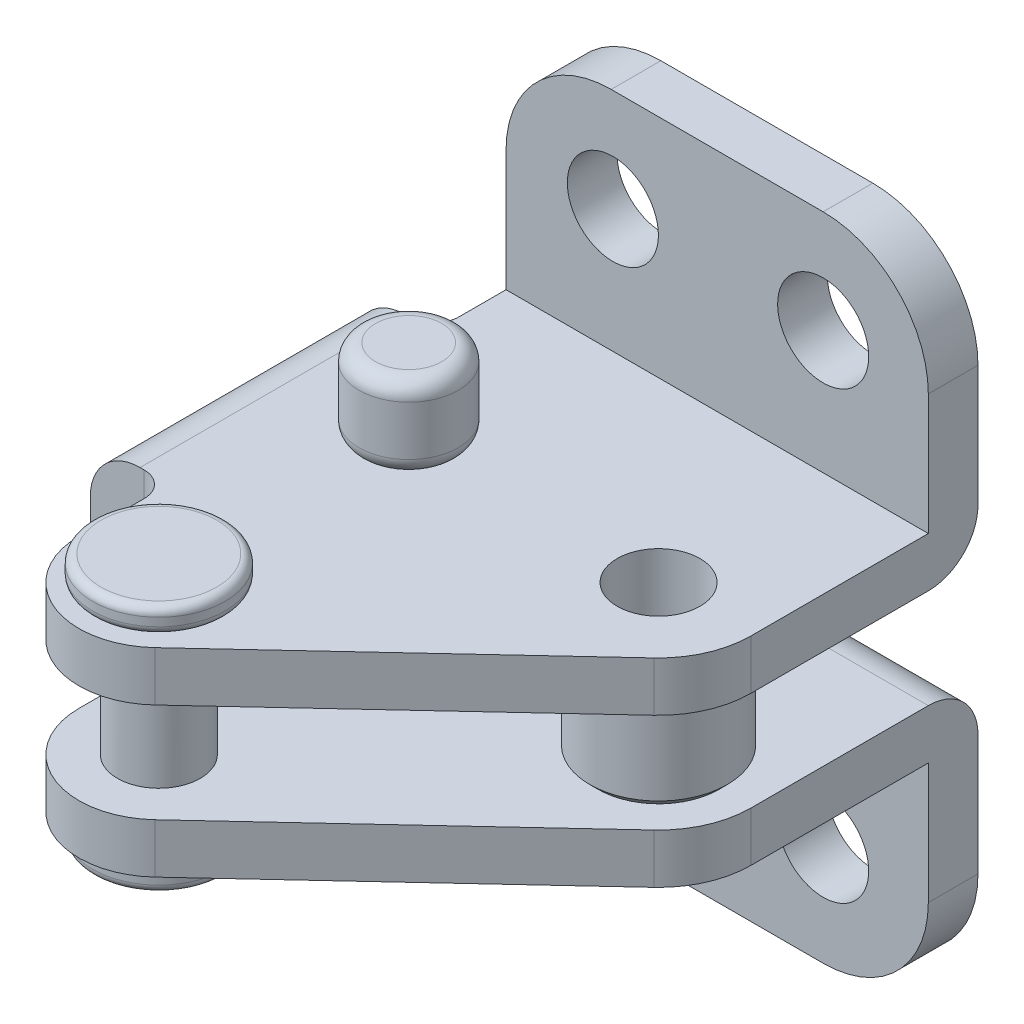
ISO-10303-21;
HEADER;
FILE_DESCRIPTION(('STEP AP214'),'2;1');
FILE_NAME('part.step','',(''),(''),'','','');
FILE_SCHEMA(('AUTOMOTIVE_DESIGN { 1 0 10303 214 1 1 1 1 }'));
ENDSEC;
DATA;
#1=APPLICATION_CONTEXT('core data for automotive mechanical design processes');
#2=APPLICATION_PROTOCOL_DEFINITION('international standard','automotive_design',2000,#1);
#3=PRODUCT_CONTEXT('',#1,'mechanical');
#4=PRODUCT('Part','Part','',(#3));
#5=PRODUCT_RELATED_PRODUCT_CATEGORY('part','',(#4));
#6=PRODUCT_DEFINITION_FORMATION('','',#4);
#7=PRODUCT_DEFINITION_CONTEXT('part definition',#1,'design');
#8=PRODUCT_DEFINITION('design','',#6,#7);
#9=PRODUCT_DEFINITION_SHAPE('','',#8);
#10=(LENGTH_UNIT() NAMED_UNIT(*) SI_UNIT(.MILLI.,.METRE.));
#11=(NAMED_UNIT(*) PLANE_ANGLE_UNIT() SI_UNIT($,.RADIAN.));
#12=(NAMED_UNIT(*) SI_UNIT($,.STERADIAN.) SOLID_ANGLE_UNIT());
#13=UNCERTAINTY_MEASURE_WITH_UNIT(LENGTH_MEASURE(1.E-05),#10,'distance_accuracy_value','');
#14=(GEOMETRIC_REPRESENTATION_CONTEXT(3) GLOBAL_UNCERTAINTY_ASSIGNED_CONTEXT((#13)) GLOBAL_UNIT_ASSIGNED_CONTEXT((#10,
#11,#12)) REPRESENTATION_CONTEXT('',''));
#15=CARTESIAN_POINT('',(0.,0.,0.));
#16=DIRECTION('',(0.,0.,1.));
#17=DIRECTION('',(1.,0.,0.));
#18=AXIS2_PLACEMENT_3D('',#15,#16,#17);
#19=CARTESIAN_POINT('',(13.4619999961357,10.4499999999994,13.7020594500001));
#20=DIRECTION('',(0.,1.,0.));
#21=DIRECTION('',(-1.,0.,0.));
#22=AXIS2_PLACEMENT_3D('',#19,#20,#21);
#23=CYLINDRICAL_SURFACE('',#22,4.15);
#24=CARTESIAN_POINT('',(13.4619999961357,15.9499999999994,13.7020594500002));
#25=DIRECTION('',(0.,-1.,0.));
#26=DIRECTION('',(1.,0.,0.));
#27=AXIS2_PLACEMENT_3D('',#24,#25,#26);
#28=CIRCLE('',#27,4.15);
#29=CARTESIAN_POINT('',(17.6119999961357,15.9499999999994,13.7020594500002));
#30=VERTEX_POINT('',#29);
#31=EDGE_CURVE('E25',#30,#30,#28,.T.);
#32=ORIENTED_EDGE('',*,*,#31,.T.);
#33=EDGE_LOOP('',(#32));
#34=FACE_BOUND('',#33,.T.);
#35=CARTESIAN_POINT('',(13.4619999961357,10.9499999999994,13.7020594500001));
#36=DIRECTION('',(0.,1.,0.));
#37=DIRECTION('',(1.,0.,0.));
#38=AXIS2_PLACEMENT_3D('',#35,#36,#37);
#39=CIRCLE('',#38,4.15);
#40=CARTESIAN_POINT('',(17.6119999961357,10.9499999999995,13.7020594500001));
#41=VERTEX_POINT('',#40);
#42=EDGE_CURVE('E9',#41,#41,#39,.T.);
#43=ORIENTED_EDGE('',*,*,#42,.T.);
#44=EDGE_LOOP('',(#43));
#45=FACE_BOUND('',#44,.T.);
#46=ADVANCED_FACE('F14',(#34,#45),#23,.T.);
#47=CARTESIAN_POINT('',(13.4619999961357,10.4499999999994,13.7020594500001));
#48=DIRECTION('',(0.,1.,0.));
#49=DIRECTION('',(-1.,0.,0.));
#50=AXIS2_PLACEMENT_3D('',#47,#48,#49);
#51=CONICAL_SURFACE('',#50,3.65,0.785398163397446);
#52=ORIENTED_EDGE('',*,*,#42,.F.);
#53=EDGE_LOOP('',(#52));
#54=FACE_BOUND('',#53,.T.);
#55=CARTESIAN_POINT('',(13.4619999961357,10.4499999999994,13.7020594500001));
#56=DIRECTION('',(0.,-1.,0.));
#57=DIRECTION('',(1.,0.,0.));
#58=AXIS2_PLACEMENT_3D('',#55,#56,#57);
#59=CIRCLE('',#58,3.65);
#60=CARTESIAN_POINT('',(17.1119999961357,10.4499999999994,13.7020594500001));
#61=VERTEX_POINT('',#60);
#62=EDGE_CURVE('E2349',#61,#61,#59,.T.);
#63=ORIENTED_EDGE('',*,*,#62,.F.);
#64=EDGE_LOOP('',(#63));
#65=FACE_BOUND('',#64,.T.);
#66=ADVANCED_FACE('F1133',(#54,#65),#51,.T.);
#67=CARTESIAN_POINT('',(13.4619999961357,15.9499999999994,13.7020594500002));
#68=DIRECTION('',(0.,-1.,0.));
#69=DIRECTION('',(1.,0.,0.));
#70=AXIS2_PLACEMENT_3D('',#67,#68,#69);
#71=CONICAL_SURFACE('',#70,4.15,0.785398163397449);
#72=ORIENTED_EDGE('',*,*,#31,.F.);
#73=EDGE_LOOP('',(#72));
#74=FACE_BOUND('',#73,.T.);
#75=CARTESIAN_POINT('',(13.4619999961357,16.4499999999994,13.7020594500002));
#76=DIRECTION('',(0.,1.,0.));
#77=DIRECTION('',(1.,0.,0.));
#78=AXIS2_PLACEMENT_3D('',#75,#76,#77);
#79=CIRCLE('',#78,3.65);
#80=CARTESIAN_POINT('',(17.1119999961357,16.4499999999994,13.7020594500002));
#81=VERTEX_POINT('',#80);
#82=EDGE_CURVE('E1893',#81,#81,#79,.T.);
#83=ORIENTED_EDGE('',*,*,#82,.F.);
#84=EDGE_LOOP('',(#83));
#85=FACE_BOUND('',#84,.T.);
#86=ADVANCED_FACE('F1101',(#74,#85),#71,.T.);
#87=CARTESIAN_POINT('',(-1.62559999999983,20.954,28.7896594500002));
#88=DIRECTION('',(0.,-1.,0.));
#89=DIRECTION('',(1.,0.,0.));
#90=AXIS2_PLACEMENT_3D('',#87,#88,#89);
#91=PLANE('',#90);
#92=CARTESIAN_POINT('',(-1.62559999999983,20.954,28.7896594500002));
#93=DIRECTION('',(0.,1.,0.));
#94=DIRECTION('',(1.,0.,0.));
#95=AXIS2_PLACEMENT_3D('',#92,#93,#94);
#96=CIRCLE('',#95,3.5);
#97=CARTESIAN_POINT('',(1.87440000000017,20.954,28.7896594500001));
#98=VERTEX_POINT('',#97);
#99=EDGE_CURVE('E2387',#98,#98,#96,.T.);
#100=ORIENTED_EDGE('',*,*,#99,.T.);
#101=EDGE_LOOP('',(#100));
#102=FACE_BOUND('',#101,.T.);
#103=ADVANCED_FACE('F870',(#102),#91,.F.);
#104=CARTESIAN_POINT('',(-1.62559999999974,5.94599999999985,28.7896594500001));
#105=DIRECTION('',(0.,1.,0.));
#106=DIRECTION('',(0.,0.,-1.));
#107=AXIS2_PLACEMENT_3D('',#104,#105,#106);
#108=PLANE('',#107);
#109=CARTESIAN_POINT('',(-1.62559999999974,5.94599999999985,28.7896594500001));
#110=DIRECTION('',(0.,-1.,0.));
#111=DIRECTION('',(-1.,0.,0.));
#112=AXIS2_PLACEMENT_3D('',#109,#110,#111);
#113=CIRCLE('',#112,3.5);
#114=CARTESIAN_POINT('',(-5.12559999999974,5.94599999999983,28.7896594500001));
#115=VERTEX_POINT('',#114);
#116=EDGE_CURVE('E2382',#115,#115,#113,.T.);
#117=ORIENTED_EDGE('',*,*,#116,.T.);
#118=EDGE_LOOP('',(#117));
#119=FACE_BOUND('',#118,.T.);
#120=ADVANCED_FACE('F858',(#119),#108,.F.);
#121=CARTESIAN_POINT('',(-1.62560000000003,24.45,13.7020594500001));
#122=DIRECTION('',(0.,1.,0.));
#123=DIRECTION('',(-0.397703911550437,0.,-0.917513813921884));
#124=AXIS2_PLACEMENT_3D('',#121,#122,#123);
#125=PLANE('',#124);
#126=CARTESIAN_POINT('',(-1.62560000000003,24.45,13.7020594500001));
#127=DIRECTION('',(0.,1.,0.));
#128=DIRECTION('',(-0.397703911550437,0.,-0.917513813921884));
#129=AXIS2_PLACEMENT_3D('',#126,#127,#128);
#130=CIRCLE('',#129,2.);
#131=CARTESIAN_POINT('',(-2.4210078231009,24.45,11.8670318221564));
#132=VERTEX_POINT('',#131);
#133=EDGE_CURVE('E1225',#132,#132,#130,.T.);
#134=ORIENTED_EDGE('',*,*,#133,.T.);
#135=EDGE_LOOP('',(#134));
#136=FACE_BOUND('',#135,.T.);
#137=ADVANCED_FACE('F855',(#136),#125,.T.);
#138=CARTESIAN_POINT('',(-1.62559999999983,20.454,28.7896594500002));
#139=DIRECTION('',(0.,-1.,0.));
#140=DIRECTION('',(1.,0.,0.));
#141=AXIS2_PLACEMENT_3D('',#138,#139,#140);
#142=TOROIDAL_SURFACE('',#141,3.5,0.5);
#143=CARTESIAN_POINT('',(-1.62559999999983,20.454,28.7896594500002));
#144=DIRECTION('',(0.,-1.,0.));
#145=DIRECTION('',(1.,0.,0.));
#146=AXIS2_PLACEMENT_3D('',#143,#144,#145);
#147=CIRCLE('',#146,4.);
#148=CARTESIAN_POINT('',(2.37440000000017,20.454,28.7896594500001));
#149=VERTEX_POINT('',#148);
#150=EDGE_CURVE('E2391',#149,#149,#147,.T.);
#151=ORIENTED_EDGE('',*,*,#150,.F.);
#152=EDGE_LOOP('',(#151));
#153=FACE_BOUND('',#152,.T.);
#154=ORIENTED_EDGE('',*,*,#99,.F.);
#155=EDGE_LOOP('',(#154));
#156=FACE_BOUND('',#155,.T.);
#157=ADVANCED_FACE('F857',(#153,#156),#142,.T.);
#158=CARTESIAN_POINT('',(-1.62560000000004,4.95,13.7020594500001));
#159=DIRECTION('',(0.,1.,0.));
#160=DIRECTION('',(-0.397703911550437,0.,-0.917513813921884));
#161=AXIS2_PLACEMENT_3D('',#158,#159,#160);
#162=PLANE('',#161);
#163=CARTESIAN_POINT('',(-1.62560000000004,4.95,13.7020594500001));
#164=DIRECTION('',(0.,-1.,0.));
#165=DIRECTION('',(-0.397703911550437,0.,-0.917513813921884));
#166=AXIS2_PLACEMENT_3D('',#163,#164,#165);
#167=CIRCLE('',#166,2.);
#168=CARTESIAN_POINT('',(-2.42100782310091,4.95000000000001,11.8670318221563));
#169=VERTEX_POINT('',#168);
#170=EDGE_CURVE('E619',#169,#169,#167,.T.);
#171=ORIENTED_EDGE('',*,*,#170,.T.);
#172=EDGE_LOOP('',(#171));
#173=FACE_BOUND('',#172,.T.);
#174=ADVANCED_FACE('F861',(#173),#162,.F.);
#175=CARTESIAN_POINT('',(-1.62559999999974,6.44599999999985,28.7896594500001));
#176=DIRECTION('',(0.,1.,0.));
#177=DIRECTION('',(-1.,0.,0.));
#178=AXIS2_PLACEMENT_3D('',#175,#176,#177);
#179=TOROIDAL_SURFACE('',#178,3.5,0.5);
#180=CARTESIAN_POINT('',(-1.62559999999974,6.44599999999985,28.7896594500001));
#181=DIRECTION('',(0.,1.,0.));
#182=DIRECTION('',(-1.,0.,0.));
#183=AXIS2_PLACEMENT_3D('',#180,#181,#182);
#184=CIRCLE('',#183,4.);
#185=CARTESIAN_POINT('',(-5.62559999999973,6.44599999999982,28.7896594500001));
#186=VERTEX_POINT('',#185);
#187=EDGE_CURVE('E2390',#186,#186,#184,.T.);
#188=ORIENTED_EDGE('',*,*,#187,.F.);
#189=EDGE_LOOP('',(#188));
#190=FACE_BOUND('',#189,.T.);
#191=ORIENTED_EDGE('',*,*,#116,.F.);
#192=EDGE_LOOP('',(#191));
#193=FACE_BOUND('',#192,.T.);
#194=ADVANCED_FACE('F873',(#190,#193),#179,.T.);
#195=CARTESIAN_POINT('',(-1.62560000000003,23.45,13.7020594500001));
#196=DIRECTION('',(0.,1.,0.));
#197=DIRECTION('',(-0.397703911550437,0.,-0.917513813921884));
#198=AXIS2_PLACEMENT_3D('',#195,#196,#197);
#199=TOROIDAL_SURFACE('',#198,2.,1.);
#200=ORIENTED_EDGE('',*,*,#133,.F.);
#201=EDGE_LOOP('',(#200));
#202=FACE_BOUND('',#201,.T.);
#203=CARTESIAN_POINT('',(-1.62560000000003,23.45,13.7020594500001));
#204=DIRECTION('',(0.,-1.,0.));
#205=DIRECTION('',(-0.397703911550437,0.,-0.917513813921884));
#206=AXIS2_PLACEMENT_3D('',#203,#204,#205);
#207=CIRCLE('',#206,3.);
#208=CARTESIAN_POINT('',(-2.81871173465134,23.45,10.9495180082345));
#209=VERTEX_POINT('',#208);
#210=EDGE_CURVE('E1231',#209,#209,#207,.T.);
#211=ORIENTED_EDGE('',*,*,#210,.F.);
#212=EDGE_LOOP('',(#211));
#213=FACE_BOUND('',#212,.T.);
#214=ADVANCED_FACE('F879',(#202,#213),#199,.T.);
#215=CARTESIAN_POINT('',(-1.62559999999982,19.454,28.7896594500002));
#216=DIRECTION('',(0.,1.,0.));
#217=DIRECTION('',(-1.,0.,0.));
#218=AXIS2_PLACEMENT_3D('',#215,#216,#217);
#219=CYLINDRICAL_SURFACE('',#218,4.);
#220=ORIENTED_EDGE('',*,*,#150,.T.);
#221=EDGE_LOOP('',(#220));
#222=FACE_BOUND('',#221,.T.);
#223=CARTESIAN_POINT('',(-1.62559999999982,19.954,28.7896594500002));
#224=DIRECTION('',(0.,1.,0.));
#225=DIRECTION('',(1.,0.,0.));
#226=AXIS2_PLACEMENT_3D('',#223,#224,#225);
#227=CIRCLE('',#226,4.);
#228=CARTESIAN_POINT('',(2.37440000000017,19.954,28.7896594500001));
#229=VERTEX_POINT('',#228);
#230=EDGE_CURVE('E2395',#229,#229,#227,.T.);
#231=ORIENTED_EDGE('',*,*,#230,.T.);
#232=EDGE_LOOP('',(#231));
#233=FACE_BOUND('',#232,.T.);
#234=ADVANCED_FACE('F869',(#222,#233),#219,.T.);
#235=CARTESIAN_POINT('',(-1.62560000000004,5.95,13.7020594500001));
#236=DIRECTION('',(0.,1.,0.));
#237=DIRECTION('',(-0.397703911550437,0.,-0.917513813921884));
#238=AXIS2_PLACEMENT_3D('',#235,#236,#237);
#239=TOROIDAL_SURFACE('',#238,2.,1.);
#240=CARTESIAN_POINT('',(-1.62560000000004,5.95,13.7020594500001));
#241=DIRECTION('',(0.,1.,0.));
#242=DIRECTION('',(-0.397703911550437,0.,-0.917513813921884));
#243=AXIS2_PLACEMENT_3D('',#240,#241,#242);
#244=CIRCLE('',#243,3.);
#245=CARTESIAN_POINT('',(-2.81871173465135,5.95000000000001,10.9495180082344));
#246=VERTEX_POINT('',#245);
#247=EDGE_CURVE('E1236',#246,#246,#244,.T.);
#248=ORIENTED_EDGE('',*,*,#247,.F.);
#249=EDGE_LOOP('',(#248));
#250=FACE_BOUND('',#249,.T.);
#251=ORIENTED_EDGE('',*,*,#170,.F.);
#252=EDGE_LOOP('',(#251));
#253=FACE_BOUND('',#252,.T.);
#254=ADVANCED_FACE('F891',(#250,#253),#239,.T.);
#255=CARTESIAN_POINT('',(-1.62559999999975,7.44599999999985,28.7896594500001));
#256=DIRECTION('',(0.,-1.,0.));
#257=DIRECTION('',(1.,0.,0.));
#258=AXIS2_PLACEMENT_3D('',#255,#256,#257);
#259=CYLINDRICAL_SURFACE('',#258,4.);
#260=ORIENTED_EDGE('',*,*,#187,.T.);
#261=EDGE_LOOP('',(#260));
#262=FACE_BOUND('',#261,.T.);
#263=CARTESIAN_POINT('',(-1.62559999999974,6.94599999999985,28.7896594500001));
#264=DIRECTION('',(0.,-1.,0.));
#265=DIRECTION('',(-1.,0.,0.));
#266=AXIS2_PLACEMENT_3D('',#263,#264,#265);
#267=CIRCLE('',#266,4.);
#268=CARTESIAN_POINT('',(-5.62559999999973,6.94599999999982,28.7896594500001));
#269=VERTEX_POINT('',#268);
#270=EDGE_CURVE('E1902',#269,#269,#267,.T.);
#271=ORIENTED_EDGE('',*,*,#270,.T.);
#272=EDGE_LOOP('',(#271));
#273=FACE_BOUND('',#272,.T.);
#274=ADVANCED_FACE('F886',(#262,#273),#259,.T.);
#275=CARTESIAN_POINT('',(-1.62560000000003,24.45,13.7020594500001));
#276=DIRECTION('',(0.,-1.,0.));
#277=DIRECTION('',(0.397703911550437,0.,0.917513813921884));
#278=AXIS2_PLACEMENT_3D('',#275,#276,#277);
#279=CYLINDRICAL_SURFACE('',#278,3.);
#280=CARTESIAN_POINT('',(-1.62560000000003,20.45,13.7020594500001));
#281=DIRECTION('',(0.,1.,0.));
#282=DIRECTION('',(-0.397703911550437,0.,-0.917513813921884));
#283=AXIS2_PLACEMENT_3D('',#280,#281,#282);
#284=CIRCLE('',#283,3.);
#285=CARTESIAN_POINT('',(-2.81871173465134,20.45,10.9495180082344));
#286=VERTEX_POINT('',#285);
#287=EDGE_CURVE('E1220',#286,#286,#284,.T.);
#288=ORIENTED_EDGE('',*,*,#287,.T.);
#289=EDGE_LOOP('',(#288));
#290=FACE_BOUND('',#289,.T.);
#291=ORIENTED_EDGE('',*,*,#210,.T.);
#292=EDGE_LOOP('',(#291));
#293=FACE_BOUND('',#292,.T.);
#294=ADVANCED_FACE('F910',(#290,#293),#279,.T.);
#295=CARTESIAN_POINT('',(-1.62559999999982,19.954,28.7896594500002));
#296=DIRECTION('',(0.,-1.,0.));
#297=DIRECTION('',(1.,0.,0.));
#298=AXIS2_PLACEMENT_3D('',#295,#296,#297);
#299=TOROIDAL_SURFACE('',#298,3.5,0.5);
#300=CARTESIAN_POINT('',(-1.62559999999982,19.454,28.7896594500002));
#301=DIRECTION('',(0.,-1.,0.));
#302=DIRECTION('',(1.,0.,0.));
#303=AXIS2_PLACEMENT_3D('',#300,#301,#302);
#304=CIRCLE('',#303,3.5);
#305=CARTESIAN_POINT('',(1.87440000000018,19.454,28.7896594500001));
#306=VERTEX_POINT('',#305);
#307=EDGE_CURVE('E2396',#306,#306,#304,.T.);
#308=ORIENTED_EDGE('',*,*,#307,.F.);
#309=EDGE_LOOP('',(#308));
#310=FACE_BOUND('',#309,.T.);
#311=ORIENTED_EDGE('',*,*,#230,.F.);
#312=EDGE_LOOP('',(#311));
#313=FACE_BOUND('',#312,.T.);
#314=ADVANCED_FACE('F898',(#310,#313),#299,.T.);
#315=CARTESIAN_POINT('',(-1.62560000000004,7.45,13.70205945));
#316=DIRECTION('',(0.,-1.,0.));
#317=DIRECTION('',(0.397703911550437,0.,0.917513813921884));
#318=AXIS2_PLACEMENT_3D('',#315,#316,#317);
#319=CYLINDRICAL_SURFACE('',#318,3.);
#320=ORIENTED_EDGE('',*,*,#247,.T.);
#321=EDGE_LOOP('',(#320));
#322=FACE_BOUND('',#321,.T.);
#323=CARTESIAN_POINT('',(-1.62560000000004,6.45,13.7020594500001));
#324=DIRECTION('',(0.,-1.,0.));
#325=DIRECTION('',(0.397703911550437,0.,0.917513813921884));
#326=AXIS2_PLACEMENT_3D('',#323,#324,#325);
#327=CIRCLE('',#326,3.);
#328=CARTESIAN_POINT('',(-0.432488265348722,6.44999999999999,16.4546008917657));
#329=VERTEX_POINT('',#328);
#330=EDGE_CURVE('E1241',#329,#329,#327,.T.);
#331=ORIENTED_EDGE('',*,*,#330,.T.);
#332=EDGE_LOOP('',(#331));
#333=FACE_BOUND('',#332,.T.);
#334=ADVANCED_FACE('F977',(#322,#333),#319,.T.);
#335=CARTESIAN_POINT('',(-1.62559999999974,6.94599999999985,28.7896594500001));
#336=DIRECTION('',(0.,1.,0.));
#337=DIRECTION('',(-1.,0.,0.));
#338=AXIS2_PLACEMENT_3D('',#335,#336,#337);
#339=TOROIDAL_SURFACE('',#338,3.5,0.5);
#340=CARTESIAN_POINT('',(-1.62559999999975,7.44599999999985,28.7896594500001));
#341=DIRECTION('',(0.,1.,0.));
#342=DIRECTION('',(-1.,0.,0.));
#343=AXIS2_PLACEMENT_3D('',#340,#341,#342);
#344=CIRCLE('',#343,3.5);
#345=CARTESIAN_POINT('',(-5.12559999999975,7.44599999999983,28.7896594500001));
#346=VERTEX_POINT('',#345);
#347=EDGE_CURVE('E2383',#346,#346,#344,.T.);
#348=ORIENTED_EDGE('',*,*,#347,.F.);
#349=EDGE_LOOP('',(#348));
#350=FACE_BOUND('',#349,.T.);
#351=ORIENTED_EDGE('',*,*,#270,.F.);
#352=EDGE_LOOP('',(#351));
#353=FACE_BOUND('',#352,.T.);
#354=ADVANCED_FACE('F913',(#350,#353),#339,.T.);
#355=CARTESIAN_POINT('',(-1.62560000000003,20.45,13.7020594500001));
#356=DIRECTION('',(0.,1.,0.));
#357=DIRECTION('',(-0.397703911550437,0.,-0.917513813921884));
#358=AXIS2_PLACEMENT_3D('',#355,#356,#357);
#359=TOROIDAL_SURFACE('',#358,2.,1.);
#360=ORIENTED_EDGE('',*,*,#287,.F.);
#361=EDGE_LOOP('',(#360));
#362=FACE_BOUND('',#361,.T.);
#363=CARTESIAN_POINT('',(-1.62560000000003,19.45,13.7020594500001));
#364=DIRECTION('',(0.,-1.,0.));
#365=DIRECTION('',(-0.397703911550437,0.,-0.917513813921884));
#366=AXIS2_PLACEMENT_3D('',#363,#364,#365);
#367=CIRCLE('',#366,2.);
#368=CARTESIAN_POINT('',(-2.4210078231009,19.45,11.8670318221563));
#369=VERTEX_POINT('',#368);
#370=EDGE_CURVE('E1223',#369,#369,#367,.T.);
#371=ORIENTED_EDGE('',*,*,#370,.F.);
#372=EDGE_LOOP('',(#371));
#373=FACE_BOUND('',#372,.T.);
#374=ADVANCED_FACE('F956',(#362,#373),#359,.T.);
#375=CARTESIAN_POINT('',(-8.20159346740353,16.45,23.35));
#376=DIRECTION('',(0.,0.,1.));
#377=DIRECTION('',(1.,0.,0.));
#378=AXIS2_PLACEMENT_3D('',#375,#376,#377);
#379=CYLINDRICAL_SURFACE('',#378,3.);
#380=CARTESIAN_POINT('',(-8.20159346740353,16.45,23.35));
#381=DIRECTION('',(0.,0.,1.));
#382=DIRECTION('',(1.,0.,0.));
#383=AXIS2_PLACEMENT_3D('',#380,#381,#382);
#384=CIRCLE('',#383,3.);
#385=CARTESIAN_POINT('',(-8.20159346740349,19.45,23.35));
#386=VERTEX_POINT('',#385);
#387=CARTESIAN_POINT('',(-11.2015934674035,16.45,23.35));
#388=VERTEX_POINT('',#387);
#389=EDGE_CURVE('E397',#386,#388,#384,.T.);
#390=ORIENTED_EDGE('',*,*,#389,.F.);
#391=DIRECTION('',(0.,0.,1.));
#392=VECTOR('',#391,1.);
#393=CARTESIAN_POINT('',(-8.20159346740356,19.45,-4.7999999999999));
#394=LINE('',#393,#392);
#395=CARTESIAN_POINT('',(-8.20159346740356,19.45,7.35000000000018));
#396=VERTEX_POINT('',#395);
#397=EDGE_CURVE('E600',#396,#386,#394,.T.);
#398=ORIENTED_EDGE('',*,*,#397,.F.);
#399=CARTESIAN_POINT('',(-8.20159346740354,16.45,7.35000000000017));
#400=DIRECTION('',(0.,0.,1.));
#401=DIRECTION('',(1.,0.,0.));
#402=AXIS2_PLACEMENT_3D('',#399,#400,#401);
#403=CIRCLE('',#402,3.);
#404=CARTESIAN_POINT('',(-11.2015934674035,16.45,7.35000000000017));
#405=VERTEX_POINT('',#404);
#406=EDGE_CURVE('E396',#396,#405,#403,.T.);
#407=ORIENTED_EDGE('',*,*,#406,.T.);
#408=DIRECTION('',(0.,0.,1.));
#409=VECTOR('',#408,1.);
#410=CARTESIAN_POINT('',(-11.2015934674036,16.45,-4.79999999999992));
#411=LINE('',#410,#409);
#412=EDGE_CURVE('E393',#405,#388,#411,.T.);
#413=ORIENTED_EDGE('',*,*,#412,.T.);
#414=EDGE_LOOP('',(#390,#398,#407,#413));
#415=FACE_BOUND('',#414,.T.);
#416=ADVANCED_FACE('F969',(#415),#379,.T.);
#417=CARTESIAN_POINT('',(-36.1031869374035,26.75,3.00000000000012));
#418=DIRECTION('',(0.,0.,-1.));
#419=DIRECTION('',(-1.,0.,0.));
#420=AXIS2_PLACEMENT_3D('',#417,#418,#419);
#421=PLANE('',#420);
#422=CARTESIAN_POINT('',(0.,26.9,3.00000000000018));
#423=DIRECTION('',(0.,0.,-1.));
#424=DIRECTION('',(0.,1.,0.));
#425=AXIS2_PLACEMENT_3D('',#422,#423,#424);
#426=CIRCLE('',#425,2.75);
#427=CARTESIAN_POINT('',(0.,29.65,3.00000000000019));
#428=VERTEX_POINT('',#427);
#429=EDGE_CURVE('E338',#428,#428,#426,.T.);
#430=ORIENTED_EDGE('',*,*,#429,.T.);
#431=EDGE_LOOP('',(#430));
#432=FACE_BOUND('',#431,.T.);
#433=CARTESIAN_POINT('',(12.7,26.9,3.00000000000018));
#434=DIRECTION('',(0.,0.,-1.));
#435=DIRECTION('',(0.,1.,0.));
#436=AXIS2_PLACEMENT_3D('',#433,#434,#435);
#437=CIRCLE('',#436,2.75);
#438=CARTESIAN_POINT('',(12.7,29.65,3.0000000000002));
#439=VERTEX_POINT('',#438);
#440=EDGE_CURVE('E2461',#439,#439,#437,.T.);
#441=ORIENTED_EDGE('',*,*,#440,.T.);
#442=EDGE_LOOP('',(#441));
#443=FACE_BOUND('',#442,.T.);
#444=DIRECTION('',(-1.,0.,0.));
#445=VECTOR('',#444,1.);
#446=CARTESIAN_POINT('',(-36.1031869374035,19.45,3.00000000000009));
#447=LINE('',#446,#445);
#448=CARTESIAN_POINT('',(19.0499999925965,19.45,3.00000000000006));
#449=VERTEX_POINT('',#448);
#450=CARTESIAN_POINT('',(-6.45160000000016,19.45,3.00000000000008));
#451=VERTEX_POINT('',#450);
#452=EDGE_CURVE('E578',#449,#451,#447,.T.);
#453=ORIENTED_EDGE('',*,*,#452,.F.);
#454=DIRECTION('',(0.,-1.,0.));
#455=VECTOR('',#454,1.);
#456=CARTESIAN_POINT('',(19.0499999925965,8.24794054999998,3.));
#457=LINE('',#456,#455);
#458=CARTESIAN_POINT('',(19.0499999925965,26.75,3.00000000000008));
#459=VERTEX_POINT('',#458);
#460=EDGE_CURVE('E551',#459,#449,#457,.T.);
#461=ORIENTED_EDGE('',*,*,#460,.F.);
#462=CARTESIAN_POINT('',(12.6999999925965,26.75,3.00000000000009));
#463=DIRECTION('',(0.,0.,-1.));
#464=DIRECTION('',(1.,0.,0.));
#465=AXIS2_PLACEMENT_3D('',#462,#463,#464);
#466=CIRCLE('',#465,6.35);
#467=CARTESIAN_POINT('',(12.6999999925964,33.1,3.0000000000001));
#468=VERTEX_POINT('',#467);
#469=EDGE_CURVE('E376',#468,#459,#466,.T.);
#470=ORIENTED_EDGE('',*,*,#469,.F.);
#471=DIRECTION('',(1.,0.,0.));
#472=VECTOR('',#471,1.);
#473=CARTESIAN_POINT('',(-0.101599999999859,33.1,3.00000000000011));
#474=LINE('',#473,#472);
#475=CARTESIAN_POINT('',(-0.101599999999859,33.1,3.00000000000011));
#476=VERTEX_POINT('',#475);
#477=EDGE_CURVE('E18',#476,#468,#474,.T.);
#478=ORIENTED_EDGE('',*,*,#477,.F.);
#479=CARTESIAN_POINT('',(-0.101600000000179,26.75,3.00000000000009));
#480=DIRECTION('',(0.,0.,-1.));
#481=DIRECTION('',(1.,0.,0.));
#482=AXIS2_PLACEMENT_3D('',#479,#480,#481);
#483=CIRCLE('',#482,6.35);
#484=CARTESIAN_POINT('',(-6.45160000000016,26.75,3.0000000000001));
#485=VERTEX_POINT('',#484);
#486=EDGE_CURVE('E360',#485,#476,#483,.T.);
#487=ORIENTED_EDGE('',*,*,#486,.F.);
#488=DIRECTION('',(0.,1.,0.));
#489=VECTOR('',#488,1.);
#490=CARTESIAN_POINT('',(-6.45160000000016,26.75,3.0000000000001));
#491=LINE('',#490,#489);
#492=EDGE_CURVE('E387',#451,#485,#491,.T.);
#493=ORIENTED_EDGE('',*,*,#492,.F.);
#494=EDGE_LOOP('',(#453,#461,#470,#478,#487,#493));
#495=FACE_BOUND('',#494,.T.);
#496=ADVANCED_FACE('F931',(#432,#443,#495),#421,.F.);
#497=CARTESIAN_POINT('',(-1.62559999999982,19.45,28.7896594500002));
#498=DIRECTION('',(0.,1.,0.));
#499=DIRECTION('',(-1.,0.,0.));
#500=AXIS2_PLACEMENT_3D('',#497,#498,#499);
#501=CYLINDRICAL_SURFACE('',#500,3.5);
#502=ORIENTED_EDGE('',*,*,#307,.T.);
#503=EDGE_LOOP('',(#502));
#504=FACE_BOUND('',#503,.T.);
#505=CARTESIAN_POINT('',(-1.62559999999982,19.45,28.7896594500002));
#506=DIRECTION('',(0.,-1.,0.));
#507=DIRECTION('',(1.,0.,0.));
#508=AXIS2_PLACEMENT_3D('',#505,#506,#507);
#509=CIRCLE('',#508,3.5);
#510=CARTESIAN_POINT('',(1.87440000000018,19.45,28.7896594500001));
#511=VERTEX_POINT('',#510);
#512=EDGE_CURVE('E2379',#511,#511,#509,.T.);
#513=ORIENTED_EDGE('',*,*,#512,.F.);
#514=EDGE_LOOP('',(#513));
#515=FACE_BOUND('',#514,.T.);
#516=ADVANCED_FACE('F951',(#504,#515),#501,.T.);
#517=CARTESIAN_POINT('',(12.6999999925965,26.75,0.));
#518=DIRECTION('',(0.,0.,1.));
#519=DIRECTION('',(-1.,0.,0.));
#520=AXIS2_PLACEMENT_3D('',#517,#518,#519);
#521=CYLINDRICAL_SURFACE('',#520,6.35);
#522=ORIENTED_EDGE('',*,*,#469,.T.);
#523=DIRECTION('',(0.,0.,1.));
#524=VECTOR('',#523,1.);
#525=CARTESIAN_POINT('',(19.0499999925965,26.75,0.));
#526=LINE('',#525,#524);
#527=CARTESIAN_POINT('',(19.0499999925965,26.75,0.));
#528=VERTEX_POINT('',#527);
#529=EDGE_CURVE('E543',#528,#459,#526,.T.);
#530=ORIENTED_EDGE('',*,*,#529,.F.);
#531=CARTESIAN_POINT('',(12.6999999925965,26.75,0.));
#532=DIRECTION('',(0.,0.,-1.));
#533=DIRECTION('',(1.,0.,0.));
#534=AXIS2_PLACEMENT_3D('',#531,#532,#533);
#535=CIRCLE('',#534,6.35);
#536=CARTESIAN_POINT('',(12.6999999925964,33.1,1.02131844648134E-13));
#537=VERTEX_POINT('',#536);
#538=EDGE_CURVE('E382',#537,#528,#535,.T.);
#539=ORIENTED_EDGE('',*,*,#538,.F.);
#540=DIRECTION('',(0.,0.,1.));
#541=VECTOR('',#540,1.);
#542=CARTESIAN_POINT('',(12.6999999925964,33.1,1.02131844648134E-13));
#543=LINE('',#542,#541);
#544=EDGE_CURVE('E381',#537,#468,#543,.T.);
#545=ORIENTED_EDGE('',*,*,#544,.T.);
#546=EDGE_LOOP('',(#522,#530,#539,#545));
#547=FACE_BOUND('',#546,.T.);
#548=ADVANCED_FACE('F947',(#547),#521,.T.);
#549=CARTESIAN_POINT('',(-0.101599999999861,33.1,1.09504419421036E-13));
#550=DIRECTION('',(0.,-1.,0.));
#551=DIRECTION('',(1.,0.,0.));
#552=AXIS2_PLACEMENT_3D('',#549,#550,#551);
#553=PLANE('',#552);
#554=ORIENTED_EDGE('',*,*,#477,.T.);
#555=ORIENTED_EDGE('',*,*,#544,.F.);
#556=DIRECTION('',(1.,0.,0.));
#557=VECTOR('',#556,1.);
#558=CARTESIAN_POINT('',(-0.101599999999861,33.1,1.09504419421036E-13));
#559=LINE('',#558,#557);
#560=CARTESIAN_POINT('',(-0.101599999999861,33.1,1.09504419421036E-13));
#561=VERTEX_POINT('',#560);
#562=EDGE_CURVE('E386',#561,#537,#559,.T.);
#563=ORIENTED_EDGE('',*,*,#562,.F.);
#564=DIRECTION('',(0.,0.,1.));
#565=VECTOR('',#564,1.);
#566=CARTESIAN_POINT('',(-0.101599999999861,33.1,1.09504419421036E-13));
#567=LINE('',#566,#565);
#568=EDGE_CURVE('E380',#561,#476,#567,.T.);
#569=ORIENTED_EDGE('',*,*,#568,.T.);
#570=EDGE_LOOP('',(#554,#555,#563,#569));
#571=FACE_BOUND('',#570,.T.);
#572=ADVANCED_FACE('F950',(#571),#553,.F.);
#573=CARTESIAN_POINT('',(-0.101600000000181,26.75,0.));
#574=DIRECTION('',(0.,0.,1.));
#575=DIRECTION('',(-1.,0.,0.));
#576=AXIS2_PLACEMENT_3D('',#573,#574,#575);
#577=CYLINDRICAL_SURFACE('',#576,6.35);
#578=ORIENTED_EDGE('',*,*,#486,.T.);
#579=ORIENTED_EDGE('',*,*,#568,.F.);
#580=CARTESIAN_POINT('',(-0.101600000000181,26.75,0.));
#581=DIRECTION('',(0.,0.,-1.));
#582=DIRECTION('',(1.,0.,0.));
#583=AXIS2_PLACEMENT_3D('',#580,#581,#582);
#584=CIRCLE('',#583,6.35);
#585=CARTESIAN_POINT('',(-6.45160000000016,26.75,0.));
#586=VERTEX_POINT('',#585);
#587=EDGE_CURVE('E430',#586,#561,#584,.T.);
#588=ORIENTED_EDGE('',*,*,#587,.F.);
#589=DIRECTION('',(0.,0.,1.));
#590=VECTOR('',#589,1.);
#591=CARTESIAN_POINT('',(-6.45160000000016,26.75,0.));
#592=LINE('',#591,#590);
#593=EDGE_CURVE('E365',#586,#485,#592,.T.);
#594=ORIENTED_EDGE('',*,*,#593,.T.);
#595=EDGE_LOOP('',(#578,#579,#588,#594));
#596=FACE_BOUND('',#595,.T.);
#597=ADVANCED_FACE('F927',(#596),#577,.T.);
#598=CARTESIAN_POINT('',(19.0499999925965,8.24794055,0.));
#599=DIRECTION('',(-1.,0.,0.));
#600=DIRECTION('',(0.,0.,-1.));
#601=AXIS2_PLACEMENT_3D('',#598,#599,#600);
#602=PLANE('',#601);
#603=ORIENTED_EDGE('',*,*,#460,.T.);
#604=DIRECTION('',(0.,0.,1.));
#605=VECTOR('',#604,1.);
#606=CARTESIAN_POINT('',(19.0499999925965,19.45,13.7020594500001));
#607=LINE('',#606,#605);
#608=CARTESIAN_POINT('',(19.0499999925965,19.45,13.7020594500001));
#609=VERTEX_POINT('',#608);
#610=EDGE_CURVE('E538',#449,#609,#607,.T.);
#611=ORIENTED_EDGE('',*,*,#610,.T.);
#612=DIRECTION('',(0.,1.,0.));
#613=VECTOR('',#612,1.);
#614=CARTESIAN_POINT('',(19.0499999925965,16.45,13.7020594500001));
#615=LINE('',#614,#613);
#616=CARTESIAN_POINT('',(19.0499999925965,16.45,13.7020594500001));
#617=VERTEX_POINT('',#616);
#618=EDGE_CURVE('E574',#617,#609,#615,.T.);
#619=ORIENTED_EDGE('',*,*,#618,.F.);
#620=DIRECTION('',(0.,0.,1.));
#621=VECTOR('',#620,1.);
#622=CARTESIAN_POINT('',(19.0499999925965,16.45,13.7020594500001));
#623=LINE('',#622,#621);
#624=CARTESIAN_POINT('',(19.0499999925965,16.45,3.00000000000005));
#625=VERTEX_POINT('',#624);
#626=EDGE_CURVE('E398',#625,#617,#623,.T.);
#627=ORIENTED_EDGE('',*,*,#626,.F.);
#628=CARTESIAN_POINT('',(19.0499999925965,19.45,3.00000000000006));
#629=DIRECTION('',(-1.,0.,0.));
#630=DIRECTION('',(0.,-1.,0.));
#631=AXIS2_PLACEMENT_3D('',#628,#629,#630);
#632=CIRCLE('',#631,3.);
#633=CARTESIAN_POINT('',(19.0499999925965,19.45,0.));
#634=VERTEX_POINT('',#633);
#635=EDGE_CURVE('E533',#634,#625,#632,.T.);
#636=ORIENTED_EDGE('',*,*,#635,.F.);
#637=DIRECTION('',(0.,-1.,0.));
#638=VECTOR('',#637,1.);
#639=CARTESIAN_POINT('',(19.0499999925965,8.24794055,0.));
#640=LINE('',#639,#638);
#641=EDGE_CURVE('E560',#528,#634,#640,.T.);
#642=ORIENTED_EDGE('',*,*,#641,.F.);
#643=ORIENTED_EDGE('',*,*,#529,.T.);
#644=EDGE_LOOP('',(#603,#611,#619,#627,#636,#642,#643));
#645=FACE_BOUND('',#644,.T.);
#646=ADVANCED_FACE('F945',(#645),#602,.F.);
#647=CARTESIAN_POINT('',(-11.2015934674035,-10.9515934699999,-4.8));
#648=DIRECTION('',(1.,0.,0.));
#649=DIRECTION('',(0.,1.,0.));
#650=AXIS2_PLACEMENT_3D('',#647,#648,#649);
#651=PLANE('',#650);
#652=ORIENTED_EDGE('',*,*,#412,.F.);
#653=DIRECTION('',(0.,1.,0.));
#654=VECTOR('',#653,1.);
#655=CARTESIAN_POINT('',(-11.2015934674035,9.70000653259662,7.35000000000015));
#656=LINE('',#655,#654);
#657=CARTESIAN_POINT('',(-11.2015934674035,10.45,7.35000000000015));
#658=VERTEX_POINT('',#657);
#659=EDGE_CURVE('E590',#658,#405,#656,.T.);
#660=ORIENTED_EDGE('',*,*,#659,.F.);
#661=DIRECTION('',(0.,0.,1.));
#662=VECTOR('',#661,1.);
#663=CARTESIAN_POINT('',(-11.2015934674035,10.45,-4.8));
#664=LINE('',#663,#662);
#665=CARTESIAN_POINT('',(-11.2015934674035,10.45,23.35));
#666=VERTEX_POINT('',#665);
#667=EDGE_CURVE('E280',#658,#666,#664,.T.);
#668=ORIENTED_EDGE('',*,*,#667,.T.);
#669=DIRECTION('',(0.,-1.,0.));
#670=VECTOR('',#669,1.);
#671=CARTESIAN_POINT('',(-11.2015934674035,9.70000653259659,23.35));
#672=LINE('',#671,#670);
#673=EDGE_CURVE('E502',#388,#666,#672,.T.);
#674=ORIENTED_EDGE('',*,*,#673,.F.);
#675=EDGE_LOOP('',(#652,#660,#668,#674));
#676=FACE_BOUND('',#675,.T.);
#677=ADVANCED_FACE('F974',(#676),#651,.F.);
#678=CARTESIAN_POINT('',(-1.62560000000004,6.45,13.7020594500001));
#679=DIRECTION('',(0.,-1.,0.));
#680=DIRECTION('',(0.397703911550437,0.,0.917513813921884));
#681=AXIS2_PLACEMENT_3D('',#678,#679,#680);
#682=TOROIDAL_SURFACE('',#681,2.,1.);
#683=ORIENTED_EDGE('',*,*,#330,.F.);
#684=EDGE_LOOP('',(#683));
#685=FACE_BOUND('',#684,.T.);
#686=CARTESIAN_POINT('',(-1.62560000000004,7.45,13.70205945));
#687=DIRECTION('',(0.,1.,0.));
#688=DIRECTION('',(0.397703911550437,0.,0.917513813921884));
#689=AXIS2_PLACEMENT_3D('',#686,#687,#688);
#690=CIRCLE('',#689,2.);
#691=CARTESIAN_POINT('',(-0.83019217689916,7.44999999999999,15.5370870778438));
#692=VERTEX_POINT('',#691);
#693=EDGE_CURVE('E1233',#692,#692,#690,.T.);
#694=ORIENTED_EDGE('',*,*,#693,.F.);
#695=EDGE_LOOP('',(#694));
#696=FACE_BOUND('',#695,.T.);
#697=ADVANCED_FACE('F963',(#685,#696),#682,.T.);
#698=CARTESIAN_POINT('',(-8.20159346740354,10.45,7.35000000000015));
#699=DIRECTION('',(0.,0.,-1.));
#700=DIRECTION('',(0.,1.,0.));
#701=AXIS2_PLACEMENT_3D('',#698,#699,#700);
#702=CYLINDRICAL_SURFACE('',#701,3.);
#703=CARTESIAN_POINT('',(-8.20159346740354,10.45,7.35000000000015));
#704=DIRECTION('',(0.,0.,-1.));
#705=DIRECTION('',(0.,1.,0.));
#706=AXIS2_PLACEMENT_3D('',#703,#704,#705);
#707=CIRCLE('',#706,3.);
#708=CARTESIAN_POINT('',(-8.20159346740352,7.45,7.35000000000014));
#709=VERTEX_POINT('',#708);
#710=EDGE_CURVE('E442',#709,#658,#707,.T.);
#711=ORIENTED_EDGE('',*,*,#710,.F.);
#712=DIRECTION('',(0.,0.,1.));
#713=VECTOR('',#712,1.);
#714=CARTESIAN_POINT('',(-8.20159346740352,7.45,-4.8));
#715=LINE('',#714,#713);
#716=CARTESIAN_POINT('',(-8.20159346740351,7.45,23.35));
#717=VERTEX_POINT('',#716);
#718=EDGE_CURVE('E409',#709,#717,#715,.T.);
#719=ORIENTED_EDGE('',*,*,#718,.T.);
#720=CARTESIAN_POINT('',(-8.20159346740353,10.45,23.35));
#721=DIRECTION('',(0.,0.,-1.));
#722=DIRECTION('',(0.,1.,0.));
#723=AXIS2_PLACEMENT_3D('',#720,#721,#722);
#724=CIRCLE('',#723,3.);
#725=EDGE_CURVE('E413',#717,#666,#724,.T.);
#726=ORIENTED_EDGE('',*,*,#725,.T.);
#727=ORIENTED_EDGE('',*,*,#667,.F.);
#728=EDGE_LOOP('',(#711,#719,#726,#727));
#729=FACE_BOUND('',#728,.T.);
#730=ADVANCED_FACE('F962',(#729),#702,.T.);
#731=CARTESIAN_POINT('',(12.7000000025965,0.150000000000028,3.));
#732=DIRECTION('',(0.,0.,-1.));
#733=DIRECTION('',(0.,-1.,0.));
#734=AXIS2_PLACEMENT_3D('',#731,#732,#733);
#735=PLANE('',#734);
#736=DIRECTION('',(1.,0.,0.));
#737=VECTOR('',#736,1.);
#738=CARTESIAN_POINT('',(12.7000000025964,7.45000000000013,3.));
#739=LINE('',#738,#737);
#740=CARTESIAN_POINT('',(-6.45160000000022,7.45,3.00000000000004));
#741=VERTEX_POINT('',#740);
#742=CARTESIAN_POINT('',(19.0500000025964,7.45000000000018,3.));
#743=VERTEX_POINT('',#742);
#744=EDGE_CURVE('E344',#741,#743,#739,.T.);
#745=ORIENTED_EDGE('',*,*,#744,.F.);
#746=DIRECTION('',(0.,1.,0.));
#747=VECTOR('',#746,1.);
#748=CARTESIAN_POINT('',(-6.45160000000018,0.14999999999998,3.));
#749=LINE('',#748,#747);
#750=CARTESIAN_POINT('',(-6.45160000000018,0.14999999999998,3.));
#751=VERTEX_POINT('',#750);
#752=EDGE_CURVE('E417',#751,#741,#749,.T.);
#753=ORIENTED_EDGE('',*,*,#752,.F.);
#754=CARTESIAN_POINT('',(-0.101599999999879,0.150000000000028,3.));
#755=DIRECTION('',(0.,0.,-1.));
#756=DIRECTION('',(-1.,0.,0.));
#757=AXIS2_PLACEMENT_3D('',#754,#755,#756);
#758=CIRCLE('',#757,6.35000000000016);
#759=CARTESIAN_POINT('',(-0.101599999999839,-6.2,3.));
#760=VERTEX_POINT('',#759);
#761=EDGE_CURVE('E326',#760,#751,#758,.T.);
#762=ORIENTED_EDGE('',*,*,#761,.F.);
#763=DIRECTION('',(-1.,0.,0.));
#764=VECTOR('',#763,1.);
#765=CARTESIAN_POINT('',(-0.101599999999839,-6.2,3.));
#766=LINE('',#765,#764);
#767=CARTESIAN_POINT('',(12.7000000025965,-6.2,3.));
#768=VERTEX_POINT('',#767);
#769=EDGE_CURVE('E321',#768,#760,#766,.T.);
#770=ORIENTED_EDGE('',*,*,#769,.F.);
#771=CARTESIAN_POINT('',(12.7000000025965,0.150000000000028,3.));
#772=DIRECTION('',(0.,0.,-1.));
#773=DIRECTION('',(-1.,0.,0.));
#774=AXIS2_PLACEMENT_3D('',#771,#772,#773);
#775=CIRCLE('',#774,6.35);
#776=CARTESIAN_POINT('',(19.0500000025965,0.150000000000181,3.));
#777=VERTEX_POINT('',#776);
#778=EDGE_CURVE('E426',#777,#768,#775,.T.);
#779=ORIENTED_EDGE('',*,*,#778,.F.);
#780=DIRECTION('',(0.,-1.,0.));
#781=VECTOR('',#780,1.);
#782=CARTESIAN_POINT('',(19.0500000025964,18.6520594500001,3.00000000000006));
#783=LINE('',#782,#781);
#784=EDGE_CURVE('E333',#743,#777,#783,.T.);
#785=ORIENTED_EDGE('',*,*,#784,.F.);
#786=EDGE_LOOP('',(#745,#753,#762,#770,#779,#785));
#787=FACE_BOUND('',#786,.T.);
#788=CARTESIAN_POINT('',(0.,0.,3.));
#789=DIRECTION('',(0.,0.,-1.));
#790=DIRECTION('',(-1.,0.,0.));
#791=AXIS2_PLACEMENT_3D('',#788,#789,#790);
#792=CIRCLE('',#791,2.75);
#793=CARTESIAN_POINT('',(-2.75,0.,3.));
#794=VERTEX_POINT('',#793);
#795=EDGE_CURVE('E327',#794,#794,#792,.T.);
#796=ORIENTED_EDGE('',*,*,#795,.T.);
#797=EDGE_LOOP('',(#796));
#798=FACE_BOUND('',#797,.T.);
#799=CARTESIAN_POINT('',(12.7,0.,3.));
#800=DIRECTION('',(0.,0.,-1.));
#801=DIRECTION('',(-1.,0.,0.));
#802=AXIS2_PLACEMENT_3D('',#799,#800,#801);
#803=CIRCLE('',#802,2.75);
#804=CARTESIAN_POINT('',(9.95,0.,3.));
#805=VERTEX_POINT('',#804);
#806=EDGE_CURVE('E416',#805,#805,#803,.T.);
#807=ORIENTED_EDGE('',*,*,#806,.T.);
#808=EDGE_LOOP('',(#807));
#809=FACE_BOUND('',#808,.T.);
#810=ADVANCED_FACE('F982',(#787,#798,#809),#735,.F.);
#811=CARTESIAN_POINT('',(-1.62559999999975,7.44999999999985,28.7896594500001));
#812=DIRECTION('',(0.,-1.,0.));
#813=DIRECTION('',(1.,0.,0.));
#814=AXIS2_PLACEMENT_3D('',#811,#812,#813);
#815=CYLINDRICAL_SURFACE('',#814,3.5);
#816=ORIENTED_EDGE('',*,*,#347,.T.);
#817=EDGE_LOOP('',(#816));
#818=FACE_BOUND('',#817,.T.);
#819=CARTESIAN_POINT('',(-1.62559999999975,7.44999999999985,28.7896594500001));
#820=DIRECTION('',(0.,1.,0.));
#821=DIRECTION('',(-1.,0.,0.));
#822=AXIS2_PLACEMENT_3D('',#819,#820,#821);
#823=CIRCLE('',#822,3.5);
#824=CARTESIAN_POINT('',(-5.12559999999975,7.44999999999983,28.7896594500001));
#825=VERTEX_POINT('',#824);
#826=EDGE_CURVE('E1253',#825,#825,#823,.T.);
#827=ORIENTED_EDGE('',*,*,#826,.F.);
#828=EDGE_LOOP('',(#827));
#829=FACE_BOUND('',#828,.T.);
#830=ADVANCED_FACE('F1143',(#818,#829),#815,.T.);
#831=CARTESIAN_POINT('',(0.,0.,0.));
#832=DIRECTION('',(0.,0.,1.));
#833=DIRECTION('',(1.,0.,0.));
#834=AXIS2_PLACEMENT_3D('',#831,#832,#833);
#835=CYLINDRICAL_SURFACE('',#834,2.75);
#836=ORIENTED_EDGE('',*,*,#795,.F.);
#837=EDGE_LOOP('',(#836));
#838=FACE_BOUND('',#837,.T.);
#839=CARTESIAN_POINT('',(0.,0.,0.));
#840=DIRECTION('',(0.,0.,-1.));
#841=DIRECTION('',(-1.,0.,0.));
#842=AXIS2_PLACEMENT_3D('',#839,#840,#841);
#843=CIRCLE('',#842,2.75);
#844=CARTESIAN_POINT('',(-2.75,0.,0.));
#845=VERTEX_POINT('',#844);
#846=EDGE_CURVE('E568',#845,#845,#843,.T.);
#847=ORIENTED_EDGE('',*,*,#846,.T.);
#848=EDGE_LOOP('',(#847));
#849=FACE_BOUND('',#848,.T.);
#850=ADVANCED_FACE('F16',(#838,#849),#835,.F.);
#851=CARTESIAN_POINT('',(12.7,0.,0.));
#852=DIRECTION('',(0.,0.,1.));
#853=DIRECTION('',(1.,0.,0.));
#854=AXIS2_PLACEMENT_3D('',#851,#852,#853);
#855=CYLINDRICAL_SURFACE('',#854,2.75);
#856=ORIENTED_EDGE('',*,*,#806,.F.);
#857=EDGE_LOOP('',(#856));
#858=FACE_BOUND('',#857,.T.);
#859=CARTESIAN_POINT('',(12.7,0.,0.));
#860=DIRECTION('',(0.,0.,-1.));
#861=DIRECTION('',(-1.,0.,0.));
#862=AXIS2_PLACEMENT_3D('',#859,#860,#861);
#863=CIRCLE('',#862,2.75);
#864=CARTESIAN_POINT('',(9.95,0.,0.));
#865=VERTEX_POINT('',#864);
#866=EDGE_CURVE('E347',#865,#865,#863,.T.);
#867=ORIENTED_EDGE('',*,*,#866,.T.);
#868=EDGE_LOOP('',(#867));
#869=FACE_BOUND('',#868,.T.);
#870=ADVANCED_FACE('F1186',(#858,#869),#855,.F.);
#871=CARTESIAN_POINT('',(-0.101599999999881,0.15,0.));
#872=DIRECTION('',(0.,0.,1.));
#873=DIRECTION('',(1.,0.,0.));
#874=AXIS2_PLACEMENT_3D('',#871,#872,#873);
#875=CYLINDRICAL_SURFACE('',#874,6.35000000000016);
#876=ORIENTED_EDGE('',*,*,#761,.T.);
#877=DIRECTION('',(0.,0.,1.));
#878=VECTOR('',#877,1.);
#879=CARTESIAN_POINT('',(-6.45160000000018,0.15,0.));
#880=LINE('',#879,#878);
#881=CARTESIAN_POINT('',(-6.45160000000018,0.15,0.));
#882=VERTEX_POINT('',#881);
#883=EDGE_CURVE('E330',#882,#751,#880,.T.);
#884=ORIENTED_EDGE('',*,*,#883,.F.);
#885=CARTESIAN_POINT('',(-0.101599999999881,0.15,0.));
#886=DIRECTION('',(0.,0.,-1.));
#887=DIRECTION('',(-1.,0.,0.));
#888=AXIS2_PLACEMENT_3D('',#885,#886,#887);
#889=CIRCLE('',#888,6.35000000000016);
#890=CARTESIAN_POINT('',(-0.101599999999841,-6.2,0.));
#891=VERTEX_POINT('',#890);
#892=EDGE_CURVE('E309',#891,#882,#889,.T.);
#893=ORIENTED_EDGE('',*,*,#892,.F.);
#894=DIRECTION('',(0.,0.,1.));
#895=VECTOR('',#894,1.);
#896=CARTESIAN_POINT('',(-0.101599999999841,-6.2,0.));
#897=LINE('',#896,#895);
#898=EDGE_CURVE('E318',#891,#760,#897,.T.);
#899=ORIENTED_EDGE('',*,*,#898,.T.);
#900=EDGE_LOOP('',(#876,#884,#893,#899));
#901=FACE_BOUND('',#900,.T.);
#902=ADVANCED_FACE('F329',(#901),#875,.T.);
#903=CARTESIAN_POINT('',(-0.101599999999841,-6.2,0.));
#904=DIRECTION('',(0.,1.,0.));
#905=DIRECTION('',(0.,0.,1.));
#906=AXIS2_PLACEMENT_3D('',#903,#904,#905);
#907=PLANE('',#906);
#908=ORIENTED_EDGE('',*,*,#769,.T.);
#909=ORIENTED_EDGE('',*,*,#898,.F.);
#910=DIRECTION('',(-1.,0.,0.));
#911=VECTOR('',#910,1.);
#912=CARTESIAN_POINT('',(-0.101599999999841,-6.2,0.));
#913=LINE('',#912,#911);
#914=CARTESIAN_POINT('',(12.7000000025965,-6.2,0.));
#915=VERTEX_POINT('',#914);
#916=EDGE_CURVE('E303',#915,#891,#913,.T.);
#917=ORIENTED_EDGE('',*,*,#916,.F.);
#918=DIRECTION('',(0.,0.,1.));
#919=VECTOR('',#918,1.);
#920=CARTESIAN_POINT('',(12.7000000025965,-6.2,0.));
#921=LINE('',#920,#919);
#922=EDGE_CURVE('E390',#915,#768,#921,.T.);
#923=ORIENTED_EDGE('',*,*,#922,.T.);
#924=EDGE_LOOP('',(#908,#909,#917,#923));
#925=FACE_BOUND('',#924,.T.);
#926=ADVANCED_FACE('F319',(#925),#907,.F.);
#927=CARTESIAN_POINT('',(12.7000000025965,0.150000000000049,0.));
#928=DIRECTION('',(0.,0.,1.));
#929=DIRECTION('',(1.,0.,0.));
#930=AXIS2_PLACEMENT_3D('',#927,#928,#929);
#931=CYLINDRICAL_SURFACE('',#930,6.35);
#932=ORIENTED_EDGE('',*,*,#778,.T.);
#933=ORIENTED_EDGE('',*,*,#922,.F.);
#934=CARTESIAN_POINT('',(12.7000000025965,0.150000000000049,0.));
#935=DIRECTION('',(0.,0.,-1.));
#936=DIRECTION('',(-1.,0.,0.));
#937=AXIS2_PLACEMENT_3D('',#934,#935,#936);
#938=CIRCLE('',#937,6.35);
#939=CARTESIAN_POINT('',(19.0500000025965,0.150000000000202,0.));
#940=VERTEX_POINT('',#939);
#941=EDGE_CURVE('E312',#940,#915,#938,.T.);
#942=ORIENTED_EDGE('',*,*,#941,.F.);
#943=DIRECTION('',(0.,0.,1.));
#944=VECTOR('',#943,1.);
#945=CARTESIAN_POINT('',(19.0500000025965,0.150000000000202,0.));
#946=LINE('',#945,#944);
#947=EDGE_CURVE('E422',#940,#777,#946,.T.);
#948=ORIENTED_EDGE('',*,*,#947,.T.);
#949=EDGE_LOOP('',(#932,#933,#942,#948));
#950=FACE_BOUND('',#949,.T.);
#951=ADVANCED_FACE('F1177',(#950),#931,.T.);
#952=CARTESIAN_POINT('',(-6.45160000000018,0.15,0.));
#953=DIRECTION('',(1.,0.,0.));
#954=DIRECTION('',(0.,1.,0.));
#955=AXIS2_PLACEMENT_3D('',#952,#953,#954);
#956=PLANE('',#955);
#957=ORIENTED_EDGE('',*,*,#752,.T.);
#958=DIRECTION('',(0.,0.,1.));
#959=VECTOR('',#958,1.);
#960=CARTESIAN_POINT('',(-6.45160000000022,7.45,-4.8));
#961=LINE('',#960,#959);
#962=CARTESIAN_POINT('',(-6.45160000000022,7.45,5.85000000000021));
#963=VERTEX_POINT('',#962);
#964=EDGE_CURVE('E40',#741,#963,#961,.T.);
#965=ORIENTED_EDGE('',*,*,#964,.T.);
#966=DIRECTION('',(0.,-1.,0.));
#967=VECTOR('',#966,1.);
#968=CARTESIAN_POINT('',(-6.45160000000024,10.45,5.85000000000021));
#969=LINE('',#968,#967);
#970=CARTESIAN_POINT('',(-6.45160000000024,10.45,5.85000000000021));
#971=VERTEX_POINT('',#970);
#972=EDGE_CURVE('E443',#971,#963,#969,.T.);
#973=ORIENTED_EDGE('',*,*,#972,.F.);
#974=DIRECTION('',(0.,0.,1.));
#975=VECTOR('',#974,1.);
#976=CARTESIAN_POINT('',(-6.45160000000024,10.45,-4.8));
#977=LINE('',#976,#975);
#978=CARTESIAN_POINT('',(-6.45160000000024,10.45,3.00000000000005));
#979=VERTEX_POINT('',#978);
#980=EDGE_CURVE('E519',#979,#971,#977,.T.);
#981=ORIENTED_EDGE('',*,*,#980,.F.);
#982=CARTESIAN_POINT('',(-6.45160000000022,7.45,3.00000000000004));
#983=DIRECTION('',(1.,0.,0.));
#984=DIRECTION('',(0.,1.,0.));
#985=AXIS2_PLACEMENT_3D('',#982,#983,#984);
#986=CIRCLE('',#985,3.);
#987=CARTESIAN_POINT('',(-6.45160000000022,7.45,0.));
#988=VERTEX_POINT('',#987);
#989=EDGE_CURVE('E475',#988,#979,#986,.T.);
#990=ORIENTED_EDGE('',*,*,#989,.F.);
#991=DIRECTION('',(0.,1.,0.));
#992=VECTOR('',#991,1.);
#993=CARTESIAN_POINT('',(-6.45160000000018,0.15,0.));
#994=LINE('',#993,#992);
#995=EDGE_CURVE('E541',#882,#988,#994,.T.);
#996=ORIENTED_EDGE('',*,*,#995,.F.);
#997=ORIENTED_EDGE('',*,*,#883,.T.);
#998=EDGE_LOOP('',(#957,#965,#973,#981,#990,#996,#997));
#999=FACE_BOUND('',#998,.T.);
#1000=ADVANCED_FACE('F751',(#999),#956,.F.);
#1001=CARTESIAN_POINT('',(-36.1031869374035,19.45,-4.79999999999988));
#1002=DIRECTION('',(0.,-1.,0.));
#1003=DIRECTION('',(1.,0.,0.));
#1004=AXIS2_PLACEMENT_3D('',#1001,#1002,#1003);
#1005=PLANE('',#1004);
#1006=ORIENTED_EDGE('',*,*,#512,.T.);
#1007=EDGE_LOOP('',(#1006));
#1008=FACE_BOUND('',#1007,.T.);
#1009=ORIENTED_EDGE('',*,*,#610,.F.);
#1010=ORIENTED_EDGE('',*,*,#452,.T.);
#1011=DIRECTION('',(0.,0.,-1.));
#1012=VECTOR('',#1011,1.);
#1013=CARTESIAN_POINT('',(-6.45160000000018,19.45,-4.7999999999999));
#1014=LINE('',#1013,#1012);
#1015=CARTESIAN_POINT('',(-6.45160000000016,19.45,5.85000000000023));
#1016=VERTEX_POINT('',#1015);
#1017=EDGE_CURVE('E355',#1016,#451,#1014,.T.);
#1018=ORIENTED_EDGE('',*,*,#1017,.F.);
#1019=CARTESIAN_POINT('',(-7.9516000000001,19.45,5.85000000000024));
#1020=DIRECTION('',(0.,1.,0.));
#1021=DIRECTION('',(1.,0.,0.));
#1022=AXIS2_PLACEMENT_3D('',#1019,#1020,#1021);
#1023=CIRCLE('',#1022,1.49999999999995);
#1024=CARTESIAN_POINT('',(-7.9516000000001,19.45,7.35000000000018));
#1025=VERTEX_POINT('',#1024);
#1026=EDGE_CURVE('E571',#1025,#1016,#1023,.T.);
#1027=ORIENTED_EDGE('',*,*,#1026,.F.);
#1028=DIRECTION('',(1.,0.,0.));
#1029=VECTOR('',#1028,1.);
#1030=CARTESIAN_POINT('',(-15.4515869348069,19.45,7.35000000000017));
#1031=LINE('',#1030,#1029);
#1032=EDGE_CURVE('E511',#396,#1025,#1031,.T.);
#1033=ORIENTED_EDGE('',*,*,#1032,.F.);
#1034=ORIENTED_EDGE('',*,*,#397,.T.);
#1035=DIRECTION('',(-1.,0.,0.));
#1036=VECTOR('',#1035,1.);
#1037=CARTESIAN_POINT('',(-15.4515869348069,19.45,23.35));
#1038=LINE('',#1037,#1036);
#1039=CARTESIAN_POINT('',(-7.9516,19.45,23.35));
#1040=VERTEX_POINT('',#1039);
#1041=EDGE_CURVE('E507',#1040,#386,#1038,.T.);
#1042=ORIENTED_EDGE('',*,*,#1041,.F.);
#1043=CARTESIAN_POINT('',(-7.9516,19.45,24.85));
#1044=DIRECTION('',(0.,1.,0.));
#1045=DIRECTION('',(1.,0.,0.));
#1046=AXIS2_PLACEMENT_3D('',#1043,#1044,#1045);
#1047=CIRCLE('',#1046,1.49999999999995);
#1048=CARTESIAN_POINT('',(-6.45160000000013,19.45,24.85));
#1049=VERTEX_POINT('',#1048);
#1050=EDGE_CURVE('E353',#1049,#1040,#1047,.T.);
#1051=ORIENTED_EDGE('',*,*,#1050,.F.);
#1052=DIRECTION('',(0.,0.,-1.));
#1053=VECTOR('',#1052,1.);
#1054=CARTESIAN_POINT('',(-6.45160000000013,19.45,24.85));
#1055=LINE('',#1054,#1053);
#1056=CARTESIAN_POINT('',(-6.45160000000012,19.45,28.7896594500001));
#1057=VERTEX_POINT('',#1056);
#1058=EDGE_CURVE('E354',#1057,#1049,#1055,.T.);
#1059=ORIENTED_EDGE('',*,*,#1058,.F.);
#1060=CARTESIAN_POINT('',(-1.6256,19.45,28.7896594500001));
#1061=DIRECTION('',(0.,-1.,0.));
#1062=DIRECTION('',(1.,0.,0.));
#1063=AXIS2_PLACEMENT_3D('',#1060,#1061,#1062);
#1064=CIRCLE('',#1063,4.82600000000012);
#1065=CARTESIAN_POINT('',(1.66285183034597,19.45,32.3218486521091));
#1066=VERTEX_POINT('',#1065);
#1067=EDGE_CURVE('E635',#1066,#1057,#1064,.T.);
#1068=ORIENTED_EDGE('',*,*,#1067,.F.);
#1069=DIRECTION('',(-0.731908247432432,0.,0.681403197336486));
#1070=VECTOR('',#1069,1.);
#1071=CARTESIAN_POINT('',(1.66285183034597,19.45,32.3218486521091));
#1072=LINE('',#1071,#1070);
#1073=CARTESIAN_POINT('',(17.2696810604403,19.45,17.7919627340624));
#1074=VERTEX_POINT('',#1073);
#1075=EDGE_CURVE('E370',#1074,#1066,#1072,.T.);
#1076=ORIENTED_EDGE('',*,*,#1075,.F.);
#1077=CARTESIAN_POINT('',(13.4619999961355,19.45,13.7020594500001));
#1078=DIRECTION('',(0.,-1.,0.));
#1079=DIRECTION('',(1.,0.,0.));
#1080=AXIS2_PLACEMENT_3D('',#1077,#1078,#1079);
#1081=CIRCLE('',#1080,5.58799999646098);
#1082=EDGE_CURVE('E371',#609,#1074,#1081,.T.);
#1083=ORIENTED_EDGE('',*,*,#1082,.F.);
#1084=EDGE_LOOP('',(#1009,#1010,#1018,#1027,#1033,#1034,#1042,#1051,#1059,#1068,#1076,#1083));
#1085=FACE_BOUND('',#1084,.T.);
#1086=ORIENTED_EDGE('',*,*,#370,.T.);
#1087=EDGE_LOOP('',(#1086));
#1088=FACE_BOUND('',#1087,.T.);
#1089=CARTESIAN_POINT('',(13.4619999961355,19.45,13.7020594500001));
#1090=DIRECTION('',(0.,-1.,0.));
#1091=DIRECTION('',(1.,0.,0.));
#1092=AXIS2_PLACEMENT_3D('',#1089,#1090,#1091);
#1093=CIRCLE('',#1092,2.49999999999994);
#1094=CARTESIAN_POINT('',(15.9619999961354,19.45,13.7020594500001));
#1095=VERTEX_POINT('',#1094);
#1096=EDGE_CURVE('E358',#1095,#1095,#1093,.T.);
#1097=ORIENTED_EDGE('',*,*,#1096,.T.);
#1098=EDGE_LOOP('',(#1097));
#1099=FACE_BOUND('',#1098,.T.);
#1100=ADVANCED_FACE('F784',(#1008,#1085,#1088,#1099),#1005,.F.);
#1101=CARTESIAN_POINT('',(-36.1031869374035,26.75,1.11239142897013E-13));
#1102=DIRECTION('',(0.,0.,-1.));
#1103=DIRECTION('',(-1.,0.,0.));
#1104=AXIS2_PLACEMENT_3D('',#1101,#1102,#1103);
#1105=PLANE('',#1104);
#1106=CARTESIAN_POINT('',(0.,26.9,1.7589359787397E-13));
#1107=DIRECTION('',(0.,0.,-1.));
#1108=DIRECTION('',(0.,1.,0.));
#1109=AXIS2_PLACEMENT_3D('',#1106,#1107,#1108);
#1110=CIRCLE('',#1109,2.75);
#1111=CARTESIAN_POINT('',(0.,29.65,1.93875285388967E-13));
#1112=VERTEX_POINT('',#1111);
#1113=EDGE_CURVE('E2464',#1112,#1112,#1110,.T.);
#1114=ORIENTED_EDGE('',*,*,#1113,.F.);
#1115=EDGE_LOOP('',(#1114));
#1116=FACE_BOUND('',#1115,.T.);
#1117=CARTESIAN_POINT('',(12.7,26.9,1.79829801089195E-13));
#1118=DIRECTION('',(0.,0.,-1.));
#1119=DIRECTION('',(0.,1.,0.));
#1120=AXIS2_PLACEMENT_3D('',#1117,#1118,#1119);
#1121=CIRCLE('',#1120,2.75);
#1122=CARTESIAN_POINT('',(12.7,29.65,1.97811488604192E-13));
#1123=VERTEX_POINT('',#1122);
#1124=EDGE_CURVE('E2374',#1123,#1123,#1121,.T.);
#1125=ORIENTED_EDGE('',*,*,#1124,.F.);
#1126=EDGE_LOOP('',(#1125));
#1127=FACE_BOUND('',#1126,.T.);
#1128=ORIENTED_EDGE('',*,*,#641,.T.);
#1129=DIRECTION('',(-1.,0.,0.));
#1130=VECTOR('',#1129,1.);
#1131=CARTESIAN_POINT('',(-36.1031869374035,19.45,0.));
#1132=LINE('',#1131,#1130);
#1133=CARTESIAN_POINT('',(-6.45160000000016,19.45,0.));
#1134=VERTEX_POINT('',#1133);
#1135=EDGE_CURVE('E610',#634,#1134,#1132,.T.);
#1136=ORIENTED_EDGE('',*,*,#1135,.T.);
#1137=DIRECTION('',(0.,1.,0.));
#1138=VECTOR('',#1137,1.);
#1139=CARTESIAN_POINT('',(-6.45160000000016,26.75,0.));
#1140=LINE('',#1139,#1138);
#1141=EDGE_CURVE('E434',#1134,#586,#1140,.T.);
#1142=ORIENTED_EDGE('',*,*,#1141,.T.);
#1143=ORIENTED_EDGE('',*,*,#587,.T.);
#1144=ORIENTED_EDGE('',*,*,#562,.T.);
#1145=ORIENTED_EDGE('',*,*,#538,.T.);
#1146=EDGE_LOOP('',(#1128,#1136,#1142,#1143,#1144,#1145));
#1147=FACE_BOUND('',#1146,.T.);
#1148=ADVANCED_FACE('F905',(#1116,#1127,#1147),#1105,.T.);
#1149=CARTESIAN_POINT('',(-6.45160000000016,19.45,0.));
#1150=DIRECTION('',(-1.,0.,0.));
#1151=DIRECTION('',(0.,0.,-1.));
#1152=AXIS2_PLACEMENT_3D('',#1149,#1150,#1151);
#1153=PLANE('',#1152);
#1154=ORIENTED_EDGE('',*,*,#1017,.T.);
#1155=ORIENTED_EDGE('',*,*,#492,.T.);
#1156=ORIENTED_EDGE('',*,*,#593,.F.);
#1157=ORIENTED_EDGE('',*,*,#1141,.F.);
#1158=CARTESIAN_POINT('',(-6.45160000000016,19.45,3.00000000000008));
#1159=DIRECTION('',(-1.,0.,0.));
#1160=DIRECTION('',(0.,-1.,0.));
#1161=AXIS2_PLACEMENT_3D('',#1158,#1159,#1160);
#1162=CIRCLE('',#1161,3.);
#1163=CARTESIAN_POINT('',(-6.45160000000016,16.45,3.00000000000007));
#1164=VERTEX_POINT('',#1163);
#1165=EDGE_CURVE('E364',#1134,#1164,#1162,.T.);
#1166=ORIENTED_EDGE('',*,*,#1165,.T.);
#1167=DIRECTION('',(0.,0.,-1.));
#1168=VECTOR('',#1167,1.);
#1169=CARTESIAN_POINT('',(-6.45160000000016,16.45,-4.79999999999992));
#1170=LINE('',#1169,#1168);
#1171=CARTESIAN_POINT('',(-6.45160000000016,16.45,5.85000000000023));
#1172=VERTEX_POINT('',#1171);
#1173=EDGE_CURVE('E526',#1172,#1164,#1170,.T.);
#1174=ORIENTED_EDGE('',*,*,#1173,.F.);
#1175=DIRECTION('',(0.,1.,0.));
#1176=VECTOR('',#1175,1.);
#1177=CARTESIAN_POINT('',(-6.45160000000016,16.45,5.85000000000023));
#1178=LINE('',#1177,#1176);
#1179=EDGE_CURVE('E359',#1172,#1016,#1178,.T.);
#1180=ORIENTED_EDGE('',*,*,#1179,.T.);
#1181=EDGE_LOOP('',(#1154,#1155,#1156,#1157,#1166,#1174,#1180));
#1182=FACE_BOUND('',#1181,.T.);
#1183=ADVANCED_FACE('F918',(#1182),#1153,.T.);
#1184=CARTESIAN_POINT('',(-8.20159346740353,9.70000653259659,23.35));
#1185=DIRECTION('',(0.,0.,-1.));
#1186=DIRECTION('',(0.,-1.,0.));
#1187=AXIS2_PLACEMENT_3D('',#1184,#1185,#1186);
#1188=PLANE('',#1187);
#1189=DIRECTION('',(0.,-1.,0.));
#1190=VECTOR('',#1189,1.);
#1191=CARTESIAN_POINT('',(-8.20159346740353,9.70000653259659,23.35));
#1192=LINE('',#1191,#1190);
#1193=CARTESIAN_POINT('',(-8.20159346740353,16.45,23.35));
#1194=VERTEX_POINT('',#1193);
#1195=CARTESIAN_POINT('',(-8.20159346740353,10.45,23.35));
#1196=VERTEX_POINT('',#1195);
#1197=EDGE_CURVE('E497',#1194,#1196,#1192,.T.);
#1198=ORIENTED_EDGE('',*,*,#1197,.F.);
#1199=DIRECTION('',(-1.,0.,0.));
#1200=VECTOR('',#1199,1.);
#1201=CARTESIAN_POINT('',(-15.4515869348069,16.45,23.35));
#1202=LINE('',#1201,#1200);
#1203=CARTESIAN_POINT('',(-7.9516,16.45,23.35));
#1204=VERTEX_POINT('',#1203);
#1205=EDGE_CURVE('E479',#1204,#1194,#1202,.T.);
#1206=ORIENTED_EDGE('',*,*,#1205,.F.);
#1207=DIRECTION('',(0.,1.,0.));
#1208=VECTOR('',#1207,1.);
#1209=CARTESIAN_POINT('',(-7.9516,16.45,23.35));
#1210=LINE('',#1209,#1208);
#1211=EDGE_CURVE('E512',#1204,#1040,#1210,.T.);
#1212=ORIENTED_EDGE('',*,*,#1211,.T.);
#1213=ORIENTED_EDGE('',*,*,#1041,.T.);
#1214=ORIENTED_EDGE('',*,*,#389,.T.);
#1215=ORIENTED_EDGE('',*,*,#673,.T.);
#1216=ORIENTED_EDGE('',*,*,#725,.F.);
#1217=DIRECTION('',(1.,0.,0.));
#1218=VECTOR('',#1217,1.);
#1219=CARTESIAN_POINT('',(-7.95160000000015,7.45,23.35));
#1220=LINE('',#1219,#1218);
#1221=CARTESIAN_POINT('',(-7.95160000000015,7.45,23.35));
#1222=VERTEX_POINT('',#1221);
#1223=EDGE_CURVE('E444',#717,#1222,#1220,.T.);
#1224=ORIENTED_EDGE('',*,*,#1223,.T.);
#1225=DIRECTION('',(0.,-1.,0.));
#1226=VECTOR('',#1225,1.);
#1227=CARTESIAN_POINT('',(-7.95160000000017,10.45,23.35));
#1228=LINE('',#1227,#1226);
#1229=CARTESIAN_POINT('',(-7.95160000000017,10.45,23.35));
#1230=VERTEX_POINT('',#1229);
#1231=EDGE_CURVE('E459',#1230,#1222,#1228,.T.);
#1232=ORIENTED_EDGE('',*,*,#1231,.F.);
#1233=DIRECTION('',(1.,0.,0.));
#1234=VECTOR('',#1233,1.);
#1235=CARTESIAN_POINT('',(-7.95160000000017,10.45,23.35));
#1236=LINE('',#1235,#1234);
#1237=EDGE_CURVE('E471',#1196,#1230,#1236,.T.);
#1238=ORIENTED_EDGE('',*,*,#1237,.F.);
#1239=EDGE_LOOP('',(#1198,#1206,#1212,#1213,#1214,#1215,#1216,#1224,#1232,#1238));
#1240=FACE_BOUND('',#1239,.T.);
#1241=ADVANCED_FACE('F920',(#1240),#1188,.F.);
#1242=CARTESIAN_POINT('',(-8.20159346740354,9.70000653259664,7.35000000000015));
#1243=DIRECTION('',(0.,0.,1.));
#1244=DIRECTION('',(0.,1.,0.));
#1245=AXIS2_PLACEMENT_3D('',#1242,#1243,#1244);
#1246=PLANE('',#1245);
#1247=ORIENTED_EDGE('',*,*,#659,.T.);
#1248=ORIENTED_EDGE('',*,*,#406,.F.);
#1249=ORIENTED_EDGE('',*,*,#1032,.T.);
#1250=DIRECTION('',(0.,1.,0.));
#1251=VECTOR('',#1250,1.);
#1252=CARTESIAN_POINT('',(-7.9516,16.45,7.35000000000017));
#1253=LINE('',#1252,#1251);
#1254=CARTESIAN_POINT('',(-7.9516,16.45,7.35000000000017));
#1255=VERTEX_POINT('',#1254);
#1256=EDGE_CURVE('E400',#1255,#1025,#1253,.T.);
#1257=ORIENTED_EDGE('',*,*,#1256,.F.);
#1258=DIRECTION('',(1.,0.,0.));
#1259=VECTOR('',#1258,1.);
#1260=CARTESIAN_POINT('',(-15.4515869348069,16.45,7.35000000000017));
#1261=LINE('',#1260,#1259);
#1262=CARTESIAN_POINT('',(-8.20159346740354,16.45,7.35000000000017));
#1263=VERTEX_POINT('',#1262);
#1264=EDGE_CURVE('E484',#1263,#1255,#1261,.T.);
#1265=ORIENTED_EDGE('',*,*,#1264,.F.);
#1266=DIRECTION('',(0.,1.,0.));
#1267=VECTOR('',#1266,1.);
#1268=CARTESIAN_POINT('',(-8.20159346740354,9.70000653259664,7.35000000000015));
#1269=LINE('',#1268,#1267);
#1270=CARTESIAN_POINT('',(-8.20159346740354,10.45,7.35000000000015));
#1271=VERTEX_POINT('',#1270);
#1272=EDGE_CURVE('E534',#1271,#1263,#1269,.T.);
#1273=ORIENTED_EDGE('',*,*,#1272,.F.);
#1274=DIRECTION('',(-1.,0.,0.));
#1275=VECTOR('',#1274,1.);
#1276=CARTESIAN_POINT('',(-7.95160000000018,10.45,7.35000000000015));
#1277=LINE('',#1276,#1275);
#1278=CARTESIAN_POINT('',(-7.95160000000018,10.45,7.35000000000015));
#1279=VERTEX_POINT('',#1278);
#1280=EDGE_CURVE('E582',#1279,#1271,#1277,.T.);
#1281=ORIENTED_EDGE('',*,*,#1280,.F.);
#1282=DIRECTION('',(0.,-1.,0.));
#1283=VECTOR('',#1282,1.);
#1284=CARTESIAN_POINT('',(-7.95160000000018,10.45,7.35000000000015));
#1285=LINE('',#1284,#1283);
#1286=CARTESIAN_POINT('',(-7.95160000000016,7.45,7.35000000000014));
#1287=VERTEX_POINT('',#1286);
#1288=EDGE_CURVE('E449',#1279,#1287,#1285,.T.);
#1289=ORIENTED_EDGE('',*,*,#1288,.T.);
#1290=DIRECTION('',(-1.,0.,0.));
#1291=VECTOR('',#1290,1.);
#1292=CARTESIAN_POINT('',(-7.95160000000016,7.45,7.35000000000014));
#1293=LINE('',#1292,#1291);
#1294=EDGE_CURVE('E453',#1287,#709,#1293,.T.);
#1295=ORIENTED_EDGE('',*,*,#1294,.T.);
#1296=ORIENTED_EDGE('',*,*,#710,.T.);
#1297=EDGE_LOOP('',(#1247,#1248,#1249,#1257,#1265,#1273,#1281,#1289,#1295,#1296));
#1298=FACE_BOUND('',#1297,.T.);
#1299=ADVANCED_FACE('F779',(#1298),#1246,.F.);
#1300=CARTESIAN_POINT('',(12.7000000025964,7.45000000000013,-4.8));
#1301=DIRECTION('',(0.,1.,0.));
#1302=DIRECTION('',(0.,0.,1.));
#1303=AXIS2_PLACEMENT_3D('',#1300,#1301,#1302);
#1304=PLANE('',#1303);
#1305=ORIENTED_EDGE('',*,*,#826,.T.);
#1306=EDGE_LOOP('',(#1305));
#1307=FACE_BOUND('',#1306,.T.);
#1308=ORIENTED_EDGE('',*,*,#964,.F.);
#1309=ORIENTED_EDGE('',*,*,#744,.T.);
#1310=DIRECTION('',(0.,0.,-1.));
#1311=VECTOR('',#1310,1.);
#1312=CARTESIAN_POINT('',(19.0500000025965,7.4500000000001,13.7020594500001));
#1313=LINE('',#1312,#1311);
#1314=CARTESIAN_POINT('',(19.0500000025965,7.4500000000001,13.7020594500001));
#1315=VERTEX_POINT('',#1314);
#1316=EDGE_CURVE('E375',#1315,#743,#1313,.T.);
#1317=ORIENTED_EDGE('',*,*,#1316,.F.);
#1318=CARTESIAN_POINT('',(13.462000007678,7.4500000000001,13.7020594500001));
#1319=DIRECTION('',(0.,1.,0.));
#1320=DIRECTION('',(-1.,0.,0.));
#1321=AXIS2_PLACEMENT_3D('',#1318,#1319,#1320);
#1322=CIRCLE('',#1321,5.58799999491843);
#1323=CARTESIAN_POINT('',(17.269681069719,7.45000000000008,17.7919627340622));
#1324=VERTEX_POINT('',#1323);
#1325=EDGE_CURVE('E604',#1324,#1315,#1322,.T.);
#1326=ORIENTED_EDGE('',*,*,#1325,.F.);
#1327=DIRECTION('',(0.731908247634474,0.,-0.681403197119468));
#1328=VECTOR('',#1327,1.);
#1329=CARTESIAN_POINT('',(1.6628518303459,7.45,32.3218486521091));
#1330=LINE('',#1329,#1328);
#1331=CARTESIAN_POINT('',(1.6628518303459,7.45,32.3218486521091));
#1332=VERTEX_POINT('',#1331);
#1333=EDGE_CURVE('E491',#1332,#1324,#1330,.T.);
#1334=ORIENTED_EDGE('',*,*,#1333,.F.);
#1335=CARTESIAN_POINT('',(-1.62560000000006,7.45,28.78965945));
#1336=DIRECTION('',(0.,1.,0.));
#1337=DIRECTION('',(-1.,0.,0.));
#1338=AXIS2_PLACEMENT_3D('',#1335,#1336,#1337);
#1339=CIRCLE('',#1338,4.82600000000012);
#1340=CARTESIAN_POINT('',(-6.45160000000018,7.4499999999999,28.78965945));
#1341=VERTEX_POINT('',#1340);
#1342=EDGE_CURVE('E589',#1341,#1332,#1339,.T.);
#1343=ORIENTED_EDGE('',*,*,#1342,.F.);
#1344=DIRECTION('',(0.,0.,1.));
#1345=VECTOR('',#1344,1.);
#1346=CARTESIAN_POINT('',(-6.45160000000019,7.45,24.85));
#1347=LINE('',#1346,#1345);
#1348=CARTESIAN_POINT('',(-6.45160000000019,7.45,24.85));
#1349=VERTEX_POINT('',#1348);
#1350=EDGE_CURVE('E627',#1349,#1341,#1347,.T.);
#1351=ORIENTED_EDGE('',*,*,#1350,.F.);
#1352=CARTESIAN_POINT('',(-7.95160000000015,7.45,24.85));
#1353=DIRECTION('',(0.,-1.,0.));
#1354=DIRECTION('',(-1.,0.,0.));
#1355=AXIS2_PLACEMENT_3D('',#1352,#1353,#1354);
#1356=CIRCLE('',#1355,1.49999999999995);
#1357=EDGE_CURVE('E454',#1222,#1349,#1356,.T.);
#1358=ORIENTED_EDGE('',*,*,#1357,.F.);
#1359=ORIENTED_EDGE('',*,*,#1223,.F.);
#1360=ORIENTED_EDGE('',*,*,#718,.F.);
#1361=ORIENTED_EDGE('',*,*,#1294,.F.);
#1362=CARTESIAN_POINT('',(-7.95160000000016,7.45,5.8500000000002));
#1363=DIRECTION('',(0.,-1.,0.));
#1364=DIRECTION('',(-1.,0.,0.));
#1365=AXIS2_PLACEMENT_3D('',#1362,#1363,#1364);
#1366=CIRCLE('',#1365,1.49999999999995);
#1367=EDGE_CURVE('E438',#963,#1287,#1366,.T.);
#1368=ORIENTED_EDGE('',*,*,#1367,.F.);
#1369=EDGE_LOOP('',(#1308,#1309,#1317,#1326,#1334,#1343,#1351,#1358,#1359,#1360,#1361,#1368));
#1370=FACE_BOUND('',#1369,.T.);
#1371=ORIENTED_EDGE('',*,*,#693,.T.);
#1372=EDGE_LOOP('',(#1371));
#1373=FACE_BOUND('',#1372,.T.);
#1374=CARTESIAN_POINT('',(13.462000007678,7.4500000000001,13.7020594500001));
#1375=DIRECTION('',(0.,1.,0.));
#1376=DIRECTION('',(-1.,0.,0.));
#1377=AXIS2_PLACEMENT_3D('',#1374,#1375,#1376);
#1378=CIRCLE('',#1377,2.49999999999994);
#1379=CARTESIAN_POINT('',(10.9620000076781,7.45000000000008,13.7020594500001));
#1380=VERTEX_POINT('',#1379);
#1381=EDGE_CURVE('E348',#1380,#1380,#1378,.T.);
#1382=ORIENTED_EDGE('',*,*,#1381,.T.);
#1383=EDGE_LOOP('',(#1382));
#1384=FACE_BOUND('',#1383,.T.);
#1385=ADVANCED_FACE('F738',(#1307,#1370,#1373,#1384),#1304,.F.);
#1386=CARTESIAN_POINT('',(12.7000000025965,0.150000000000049,0.));
#1387=DIRECTION('',(0.,0.,-1.));
#1388=DIRECTION('',(0.,-1.,0.));
#1389=AXIS2_PLACEMENT_3D('',#1386,#1387,#1388);
#1390=PLANE('',#1389);
#1391=ORIENTED_EDGE('',*,*,#995,.T.);
#1392=DIRECTION('',(1.,0.,0.));
#1393=VECTOR('',#1392,1.);
#1394=CARTESIAN_POINT('',(12.7000000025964,7.45,0.));
#1395=LINE('',#1394,#1393);
#1396=CARTESIAN_POINT('',(19.0500000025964,7.4500000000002,0.));
#1397=VERTEX_POINT('',#1396);
#1398=EDGE_CURVE('E421',#988,#1397,#1395,.T.);
#1399=ORIENTED_EDGE('',*,*,#1398,.T.);
#1400=DIRECTION('',(0.,-1.,0.));
#1401=VECTOR('',#1400,1.);
#1402=CARTESIAN_POINT('',(19.0500000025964,18.6520594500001,0.));
#1403=LINE('',#1402,#1401);
#1404=EDGE_CURVE('E418',#1397,#940,#1403,.T.);
#1405=ORIENTED_EDGE('',*,*,#1404,.T.);
#1406=ORIENTED_EDGE('',*,*,#941,.T.);
#1407=ORIENTED_EDGE('',*,*,#916,.T.);
#1408=ORIENTED_EDGE('',*,*,#892,.T.);
#1409=EDGE_LOOP('',(#1391,#1399,#1405,#1406,#1407,#1408));
#1410=FACE_BOUND('',#1409,.T.);
#1411=ORIENTED_EDGE('',*,*,#866,.F.);
#1412=EDGE_LOOP('',(#1411));
#1413=FACE_BOUND('',#1412,.T.);
#1414=ORIENTED_EDGE('',*,*,#846,.F.);
#1415=EDGE_LOOP('',(#1414));
#1416=FACE_BOUND('',#1415,.T.);
#1417=ADVANCED_FACE('F306',(#1410,#1413,#1416),#1390,.T.);
#1418=CARTESIAN_POINT('',(19.0500000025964,7.45000000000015,0.));
#1419=DIRECTION('',(1.,0.,0.));
#1420=DIRECTION('',(0.,1.,0.));
#1421=AXIS2_PLACEMENT_3D('',#1418,#1419,#1420);
#1422=PLANE('',#1421);
#1423=ORIENTED_EDGE('',*,*,#1316,.T.);
#1424=ORIENTED_EDGE('',*,*,#784,.T.);
#1425=ORIENTED_EDGE('',*,*,#947,.F.);
#1426=ORIENTED_EDGE('',*,*,#1404,.F.);
#1427=CARTESIAN_POINT('',(19.0500000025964,7.45000000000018,3.));
#1428=DIRECTION('',(1.,0.,0.));
#1429=DIRECTION('',(0.,1.,0.));
#1430=AXIS2_PLACEMENT_3D('',#1427,#1428,#1429);
#1431=CIRCLE('',#1430,3.);
#1432=CARTESIAN_POINT('',(19.0500000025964,10.4500000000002,3.00000000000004));
#1433=VERTEX_POINT('',#1432);
#1434=EDGE_CURVE('E506',#1397,#1433,#1431,.T.);
#1435=ORIENTED_EDGE('',*,*,#1434,.T.);
#1436=DIRECTION('',(0.,0.,-1.));
#1437=VECTOR('',#1436,1.);
#1438=CARTESIAN_POINT('',(19.0500000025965,10.4500000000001,13.7020594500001));
#1439=LINE('',#1438,#1437);
#1440=CARTESIAN_POINT('',(19.0500000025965,10.4500000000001,13.7020594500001));
#1441=VERTEX_POINT('',#1440);
#1442=EDGE_CURVE('E448',#1441,#1433,#1439,.T.);
#1443=ORIENTED_EDGE('',*,*,#1442,.F.);
#1444=DIRECTION('',(0.,-1.,0.));
#1445=VECTOR('',#1444,1.);
#1446=CARTESIAN_POINT('',(19.0500000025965,10.4500000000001,13.7020594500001));
#1447=LINE('',#1446,#1445);
#1448=EDGE_CURVE('E577',#1441,#1315,#1447,.T.);
#1449=ORIENTED_EDGE('',*,*,#1448,.T.);
#1450=EDGE_LOOP('',(#1423,#1424,#1425,#1426,#1435,#1443,#1449));
#1451=FACE_BOUND('',#1450,.T.);
#1452=ADVANCED_FACE('F742',(#1451),#1422,.T.);
#1453=CARTESIAN_POINT('',(-7.9516000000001,16.45,5.85000000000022));
#1454=DIRECTION('',(0.,1.,0.));
#1455=DIRECTION('',(-1.,0.,0.));
#1456=AXIS2_PLACEMENT_3D('',#1453,#1454,#1455);
#1457=CYLINDRICAL_SURFACE('',#1456,1.49999999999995);
#1458=ORIENTED_EDGE('',*,*,#1026,.T.);
#1459=ORIENTED_EDGE('',*,*,#1179,.F.);
#1460=CARTESIAN_POINT('',(-7.9516000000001,16.45,5.85000000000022));
#1461=DIRECTION('',(0.,1.,0.));
#1462=DIRECTION('',(1.,0.,0.));
#1463=AXIS2_PLACEMENT_3D('',#1460,#1461,#1462);
#1464=CIRCLE('',#1463,1.49999999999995);
#1465=EDGE_CURVE('E516',#1255,#1172,#1464,.T.);
#1466=ORIENTED_EDGE('',*,*,#1465,.F.);
#1467=ORIENTED_EDGE('',*,*,#1256,.T.);
#1468=EDGE_LOOP('',(#1458,#1459,#1466,#1467));
#1469=FACE_BOUND('',#1468,.T.);
#1470=ADVANCED_FACE('F789',(#1469),#1457,.F.);
#1471=CARTESIAN_POINT('',(-1.62560000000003,19.45,13.7020594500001));
#1472=DIRECTION('',(0.,-1.,0.));
#1473=DIRECTION('',(0.397703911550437,0.,0.917513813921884));
#1474=AXIS2_PLACEMENT_3D('',#1471,#1472,#1473);
#1475=CYLINDRICAL_SURFACE('',#1474,1.5);
#1476=CARTESIAN_POINT('',(-1.62560000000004,10.45,13.7020594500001));
#1477=DIRECTION('',(0.,1.,0.));
#1478=DIRECTION('',(-1.,0.,0.));
#1479=AXIS2_PLACEMENT_3D('',#1476,#1477,#1478);
#1480=CIRCLE('',#1479,1.5);
#1481=CARTESIAN_POINT('',(-3.12560000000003,10.45,13.7020594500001));
#1482=VERTEX_POINT('',#1481);
#1483=EDGE_CURVE('E1249',#1482,#1482,#1480,.F.);
#1484=ORIENTED_EDGE('',*,*,#1483,.F.);
#1485=EDGE_LOOP('',(#1484));
#1486=FACE_BOUND('',#1485,.T.);
#1487=CARTESIAN_POINT('',(-1.62560000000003,16.45,13.7020594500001));
#1488=DIRECTION('',(0.,-1.,0.));
#1489=DIRECTION('',(0.,0.,1.));
#1490=AXIS2_PLACEMENT_3D('',#1487,#1488,#1489);
#1491=CIRCLE('',#1490,1.5);
#1492=CARTESIAN_POINT('',(-1.62560000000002,16.45,15.2020594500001));
#1493=VERTEX_POINT('',#1492);
#1494=EDGE_CURVE('E1245',#1493,#1493,#1491,.F.);
#1495=ORIENTED_EDGE('',*,*,#1494,.F.);
#1496=EDGE_LOOP('',(#1495));
#1497=FACE_BOUND('',#1496,.T.);
#1498=ADVANCED_FACE('F1014',(#1486,#1497),#1475,.T.);
#1499=CARTESIAN_POINT('',(-1.62559999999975,7.44599999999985,28.7896594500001));
#1500=DIRECTION('',(0.,1.,0.));
#1501=DIRECTION('',(-1.,0.,0.));
#1502=AXIS2_PLACEMENT_3D('',#1499,#1500,#1501);
#1503=CYLINDRICAL_SURFACE('',#1502,2.5);
#1504=CARTESIAN_POINT('',(-1.62559999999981,16.45,28.7896594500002));
#1505=DIRECTION('',(0.,-1.,0.));
#1506=DIRECTION('',(0.,0.,1.));
#1507=AXIS2_PLACEMENT_3D('',#1504,#1505,#1506);
#1508=CIRCLE('',#1507,2.5);
#1509=CARTESIAN_POINT('',(-1.6255999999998,16.45,31.2896594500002));
#1510=VERTEX_POINT('',#1509);
#1511=EDGE_CURVE('E1888',#1510,#1510,#1508,.F.);
#1512=ORIENTED_EDGE('',*,*,#1511,.F.);
#1513=EDGE_LOOP('',(#1512));
#1514=FACE_BOUND('',#1513,.T.);
#1515=CARTESIAN_POINT('',(-1.62559999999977,10.45,28.7896594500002));
#1516=DIRECTION('',(0.,1.,0.));
#1517=DIRECTION('',(-1.,0.,0.));
#1518=AXIS2_PLACEMENT_3D('',#1515,#1516,#1517);
#1519=CIRCLE('',#1518,2.5);
#1520=CARTESIAN_POINT('',(-4.12559999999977,10.45,28.7896594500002));
#1521=VERTEX_POINT('',#1520);
#1522=EDGE_CURVE('E1894',#1521,#1521,#1519,.F.);
#1523=ORIENTED_EDGE('',*,*,#1522,.F.);
#1524=EDGE_LOOP('',(#1523));
#1525=FACE_BOUND('',#1524,.T.);
#1526=ADVANCED_FACE('F1142',(#1514,#1525),#1503,.T.);
#1527=CARTESIAN_POINT('',(13.462000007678,10.45,13.7020594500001));
#1528=DIRECTION('',(0.,-1.,0.));
#1529=DIRECTION('',(1.,0.,0.));
#1530=AXIS2_PLACEMENT_3D('',#1527,#1528,#1529);
#1531=CYLINDRICAL_SURFACE('',#1530,5.58799999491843);
#1532=ORIENTED_EDGE('',*,*,#1325,.T.);
#1533=ORIENTED_EDGE('',*,*,#1448,.F.);
#1534=CARTESIAN_POINT('',(13.462000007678,10.45,13.7020594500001));
#1535=DIRECTION('',(0.,1.,0.));
#1536=DIRECTION('',(-1.,0.,0.));
#1537=AXIS2_PLACEMENT_3D('',#1534,#1535,#1536);
#1538=CIRCLE('',#1537,5.58799999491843);
#1539=CARTESIAN_POINT('',(17.269681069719,10.45,17.7919627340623));
#1540=VERTEX_POINT('',#1539);
#1541=EDGE_CURVE('E460',#1540,#1441,#1538,.T.);
#1542=ORIENTED_EDGE('',*,*,#1541,.F.);
#1543=DIRECTION('',(0.,-1.,0.));
#1544=VECTOR('',#1543,1.);
#1545=CARTESIAN_POINT('',(17.269681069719,10.45,17.7919627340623));
#1546=LINE('',#1545,#1544);
#1547=EDGE_CURVE('E495',#1540,#1324,#1546,.T.);
#1548=ORIENTED_EDGE('',*,*,#1547,.T.);
#1549=EDGE_LOOP('',(#1532,#1533,#1542,#1548));
#1550=FACE_BOUND('',#1549,.T.);
#1551=ADVANCED_FACE('F715',(#1550),#1531,.T.);
#1552=CARTESIAN_POINT('',(1.66285183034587,10.45,32.3218486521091));
#1553=DIRECTION('',(-0.681403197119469,0.,-0.731908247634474));
#1554=DIRECTION('',(-0.731908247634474,0.,0.681403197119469));
#1555=AXIS2_PLACEMENT_3D('',#1552,#1553,#1554);
#1556=PLANE('',#1555);
#1557=ORIENTED_EDGE('',*,*,#1333,.T.);
#1558=ORIENTED_EDGE('',*,*,#1547,.F.);
#1559=DIRECTION('',(0.731908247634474,0.,-0.681403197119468));
#1560=VECTOR('',#1559,1.);
#1561=CARTESIAN_POINT('',(1.66285183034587,10.45,32.3218486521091));
#1562=LINE('',#1561,#1560);
#1563=CARTESIAN_POINT('',(1.66285183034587,10.45,32.3218486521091));
#1564=VERTEX_POINT('',#1563);
#1565=EDGE_CURVE('E464',#1564,#1540,#1562,.T.);
#1566=ORIENTED_EDGE('',*,*,#1565,.F.);
#1567=DIRECTION('',(0.,-1.,0.));
#1568=VECTOR('',#1567,1.);
#1569=CARTESIAN_POINT('',(1.66285183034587,10.45,32.3218486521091));
#1570=LINE('',#1569,#1568);
#1571=EDGE_CURVE('E496',#1564,#1332,#1570,.T.);
#1572=ORIENTED_EDGE('',*,*,#1571,.T.);
#1573=EDGE_LOOP('',(#1557,#1558,#1566,#1572));
#1574=FACE_BOUND('',#1573,.T.);
#1575=ADVANCED_FACE('F722',(#1574),#1556,.F.);
#1576=CARTESIAN_POINT('',(-1.62560000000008,10.45,28.7896594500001));
#1577=DIRECTION('',(0.,-1.,0.));
#1578=DIRECTION('',(1.,0.,0.));
#1579=AXIS2_PLACEMENT_3D('',#1576,#1577,#1578);
#1580=CYLINDRICAL_SURFACE('',#1579,4.82600000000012);
#1581=ORIENTED_EDGE('',*,*,#1342,.T.);
#1582=ORIENTED_EDGE('',*,*,#1571,.F.);
#1583=CARTESIAN_POINT('',(-1.62560000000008,10.45,28.7896594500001));
#1584=DIRECTION('',(0.,1.,0.));
#1585=DIRECTION('',(-1.,0.,0.));
#1586=AXIS2_PLACEMENT_3D('',#1583,#1584,#1585);
#1587=CIRCLE('',#1586,4.82600000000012);
#1588=CARTESIAN_POINT('',(-6.4516000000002,10.45,28.7896594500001));
#1589=VERTEX_POINT('',#1588);
#1590=EDGE_CURVE('E465',#1589,#1564,#1587,.T.);
#1591=ORIENTED_EDGE('',*,*,#1590,.F.);
#1592=DIRECTION('',(0.,-1.,0.));
#1593=VECTOR('',#1592,1.);
#1594=CARTESIAN_POINT('',(-6.4516000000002,10.45,28.7896594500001));
#1595=LINE('',#1594,#1593);
#1596=EDGE_CURVE('E623',#1589,#1341,#1595,.T.);
#1597=ORIENTED_EDGE('',*,*,#1596,.T.);
#1598=EDGE_LOOP('',(#1581,#1582,#1591,#1597));
#1599=FACE_BOUND('',#1598,.T.);
#1600=ADVANCED_FACE('F731',(#1599),#1580,.T.);
#1601=CARTESIAN_POINT('',(-6.45160000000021,10.45,24.85));
#1602=DIRECTION('',(1.,0.,0.));
#1603=DIRECTION('',(0.,1.,0.));
#1604=AXIS2_PLACEMENT_3D('',#1601,#1602,#1603);
#1605=PLANE('',#1604);
#1606=ORIENTED_EDGE('',*,*,#1350,.T.);
#1607=ORIENTED_EDGE('',*,*,#1596,.F.);
#1608=DIRECTION('',(0.,0.,1.));
#1609=VECTOR('',#1608,1.);
#1610=CARTESIAN_POINT('',(-6.45160000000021,10.45,24.85));
#1611=LINE('',#1610,#1609);
#1612=CARTESIAN_POINT('',(-6.45160000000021,10.45,24.85));
#1613=VERTEX_POINT('',#1612);
#1614=EDGE_CURVE('E191',#1613,#1589,#1611,.T.);
#1615=ORIENTED_EDGE('',*,*,#1614,.F.);
#1616=DIRECTION('',(0.,-1.,0.));
#1617=VECTOR('',#1616,1.);
#1618=CARTESIAN_POINT('',(-6.45160000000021,10.45,24.85));
#1619=LINE('',#1618,#1617);
#1620=EDGE_CURVE('E458',#1613,#1349,#1619,.T.);
#1621=ORIENTED_EDGE('',*,*,#1620,.T.);
#1622=EDGE_LOOP('',(#1606,#1607,#1615,#1621));
#1623=FACE_BOUND('',#1622,.T.);
#1624=ADVANCED_FACE('F732',(#1623),#1605,.F.);
#1625=CARTESIAN_POINT('',(-7.95160000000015,10.45,24.85));
#1626=DIRECTION('',(0.,-1.,0.));
#1627=DIRECTION('',(1.,0.,0.));
#1628=AXIS2_PLACEMENT_3D('',#1625,#1626,#1627);
#1629=CYLINDRICAL_SURFACE('',#1628,1.49999999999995);
#1630=ORIENTED_EDGE('',*,*,#1357,.T.);
#1631=ORIENTED_EDGE('',*,*,#1620,.F.);
#1632=CARTESIAN_POINT('',(-7.95160000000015,10.45,24.85));
#1633=DIRECTION('',(0.,-1.,0.));
#1634=DIRECTION('',(-1.,0.,0.));
#1635=AXIS2_PLACEMENT_3D('',#1632,#1633,#1634);
#1636=CIRCLE('',#1635,1.49999999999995);
#1637=EDGE_CURVE('E202',#1230,#1613,#1636,.T.);
#1638=ORIENTED_EDGE('',*,*,#1637,.F.);
#1639=ORIENTED_EDGE('',*,*,#1231,.T.);
#1640=EDGE_LOOP('',(#1630,#1631,#1638,#1639));
#1641=FACE_BOUND('',#1640,.T.);
#1642=ADVANCED_FACE('F966',(#1641),#1629,.F.);
#1643=CARTESIAN_POINT('',(-8.20159346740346,-10.9515934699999,-4.8));
#1644=DIRECTION('',(1.,0.,0.));
#1645=DIRECTION('',(0.,1.,0.));
#1646=AXIS2_PLACEMENT_3D('',#1643,#1644,#1645);
#1647=PLANE('',#1646);
#1648=ORIENTED_EDGE('',*,*,#1272,.T.);
#1649=DIRECTION('',(0.,0.,1.));
#1650=VECTOR('',#1649,1.);
#1651=CARTESIAN_POINT('',(-8.20159346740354,16.45,-4.79999999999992));
#1652=LINE('',#1651,#1650);
#1653=EDGE_CURVE('E501',#1263,#1194,#1652,.T.);
#1654=ORIENTED_EDGE('',*,*,#1653,.T.);
#1655=ORIENTED_EDGE('',*,*,#1197,.T.);
#1656=DIRECTION('',(0.,0.,1.));
#1657=VECTOR('',#1656,1.);
#1658=CARTESIAN_POINT('',(-8.20159346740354,10.45,-4.8));
#1659=LINE('',#1658,#1657);
#1660=EDGE_CURVE('E631',#1271,#1196,#1659,.T.);
#1661=ORIENTED_EDGE('',*,*,#1660,.F.);
#1662=EDGE_LOOP('',(#1648,#1654,#1655,#1661));
#1663=FACE_BOUND('',#1662,.T.);
#1664=ADVANCED_FACE('F960',(#1663),#1647,.T.);
#1665=CARTESIAN_POINT('',(-7.95160000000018,10.45,5.85000000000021));
#1666=DIRECTION('',(0.,-1.,0.));
#1667=DIRECTION('',(1.,0.,0.));
#1668=AXIS2_PLACEMENT_3D('',#1665,#1666,#1667);
#1669=CYLINDRICAL_SURFACE('',#1668,1.49999999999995);
#1670=ORIENTED_EDGE('',*,*,#1367,.T.);
#1671=ORIENTED_EDGE('',*,*,#1288,.F.);
#1672=CARTESIAN_POINT('',(-7.95160000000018,10.45,5.85000000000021));
#1673=DIRECTION('',(0.,-1.,0.));
#1674=DIRECTION('',(-1.,0.,0.));
#1675=AXIS2_PLACEMENT_3D('',#1672,#1673,#1674);
#1676=CIRCLE('',#1675,1.49999999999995);
#1677=EDGE_CURVE('E522',#971,#1279,#1676,.T.);
#1678=ORIENTED_EDGE('',*,*,#1677,.F.);
#1679=ORIENTED_EDGE('',*,*,#972,.T.);
#1680=EDGE_LOOP('',(#1670,#1671,#1678,#1679));
#1681=FACE_BOUND('',#1680,.T.);
#1682=ADVANCED_FACE('F957',(#1681),#1669,.F.);
#1683=CARTESIAN_POINT('',(19.0500000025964,7.45000000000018,3.));
#1684=DIRECTION('',(1.,0.,0.));
#1685=DIRECTION('',(0.,1.,0.));
#1686=AXIS2_PLACEMENT_3D('',#1683,#1684,#1685);
#1687=CYLINDRICAL_SURFACE('',#1686,3.);
#1688=ORIENTED_EDGE('',*,*,#1434,.F.);
#1689=ORIENTED_EDGE('',*,*,#1398,.F.);
#1690=ORIENTED_EDGE('',*,*,#989,.T.);
#1691=DIRECTION('',(1.,0.,0.));
#1692=VECTOR('',#1691,1.);
#1693=CARTESIAN_POINT('',(12.7000000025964,10.4500000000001,3.00000000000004));
#1694=LINE('',#1693,#1692);
#1695=EDGE_CURVE('E342',#979,#1433,#1694,.T.);
#1696=ORIENTED_EDGE('',*,*,#1695,.T.);
#1697=EDGE_LOOP('',(#1688,#1689,#1690,#1696));
#1698=FACE_BOUND('',#1697,.T.);
#1699=ADVANCED_FACE('F753',(#1698),#1687,.T.);
#1700=CARTESIAN_POINT('',(12.7000000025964,10.4500000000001,-4.8));
#1701=DIRECTION('',(0.,1.,0.));
#1702=DIRECTION('',(0.,0.,1.));
#1703=AXIS2_PLACEMENT_3D('',#1700,#1701,#1702);
#1704=PLANE('',#1703);
#1705=ORIENTED_EDGE('',*,*,#62,.T.);
#1706=EDGE_LOOP('',(#1705));
#1707=FACE_BOUND('',#1706,.T.);
#1708=ORIENTED_EDGE('',*,*,#1695,.F.);
#1709=ORIENTED_EDGE('',*,*,#980,.T.);
#1710=ORIENTED_EDGE('',*,*,#1677,.T.);
#1711=ORIENTED_EDGE('',*,*,#1280,.T.);
#1712=ORIENTED_EDGE('',*,*,#1660,.T.);
#1713=ORIENTED_EDGE('',*,*,#1237,.T.);
#1714=ORIENTED_EDGE('',*,*,#1637,.T.);
#1715=ORIENTED_EDGE('',*,*,#1614,.T.);
#1716=ORIENTED_EDGE('',*,*,#1590,.T.);
#1717=ORIENTED_EDGE('',*,*,#1565,.T.);
#1718=ORIENTED_EDGE('',*,*,#1541,.T.);
#1719=ORIENTED_EDGE('',*,*,#1442,.T.);
#1720=EDGE_LOOP('',(#1708,#1709,#1710,#1711,#1712,#1713,#1714,#1715,#1716,#1717,#1718,#1719));
#1721=FACE_BOUND('',#1720,.T.);
#1722=ORIENTED_EDGE('',*,*,#1522,.T.);
#1723=EDGE_LOOP('',(#1722));
#1724=FACE_BOUND('',#1723,.T.);
#1725=ORIENTED_EDGE('',*,*,#1483,.T.);
#1726=EDGE_LOOP('',(#1725));
#1727=FACE_BOUND('',#1726,.T.);
#1728=ADVANCED_FACE('F728',(#1707,#1721,#1724,#1727),#1704,.T.);
#1729=CARTESIAN_POINT('',(-7.9516,16.45,24.85));
#1730=DIRECTION('',(0.,1.,0.));
#1731=DIRECTION('',(-1.,0.,0.));
#1732=AXIS2_PLACEMENT_3D('',#1729,#1730,#1731);
#1733=CYLINDRICAL_SURFACE('',#1732,1.49999999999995);
#1734=ORIENTED_EDGE('',*,*,#1050,.T.);
#1735=ORIENTED_EDGE('',*,*,#1211,.F.);
#1736=CARTESIAN_POINT('',(-7.9516,16.45,24.85));
#1737=DIRECTION('',(0.,1.,0.));
#1738=DIRECTION('',(1.,0.,0.));
#1739=AXIS2_PLACEMENT_3D('',#1736,#1737,#1738);
#1740=CIRCLE('',#1739,1.49999999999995);
#1741=CARTESIAN_POINT('',(-6.45160000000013,16.45,24.85));
#1742=VERTEX_POINT('',#1741);
#1743=EDGE_CURVE('E483',#1742,#1204,#1740,.T.);
#1744=ORIENTED_EDGE('',*,*,#1743,.F.);
#1745=DIRECTION('',(0.,1.,0.));
#1746=VECTOR('',#1745,1.);
#1747=CARTESIAN_POINT('',(-6.45160000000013,16.45,24.85));
#1748=LINE('',#1747,#1746);
#1749=EDGE_CURVE('E349',#1742,#1049,#1748,.T.);
#1750=ORIENTED_EDGE('',*,*,#1749,.T.);
#1751=EDGE_LOOP('',(#1734,#1735,#1744,#1750));
#1752=FACE_BOUND('',#1751,.T.);
#1753=ADVANCED_FACE('F826',(#1752),#1733,.F.);
#1754=CARTESIAN_POINT('',(-6.45160000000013,16.45,24.85));
#1755=DIRECTION('',(1.,0.,0.));
#1756=DIRECTION('',(0.,1.,0.));
#1757=AXIS2_PLACEMENT_3D('',#1754,#1755,#1756);
#1758=PLANE('',#1757);
#1759=ORIENTED_EDGE('',*,*,#1058,.T.);
#1760=ORIENTED_EDGE('',*,*,#1749,.F.);
#1761=DIRECTION('',(0.,0.,-1.));
#1762=VECTOR('',#1761,1.);
#1763=CARTESIAN_POINT('',(-6.45160000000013,16.45,24.85));
#1764=LINE('',#1763,#1762);
#1765=CARTESIAN_POINT('',(-6.45160000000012,16.45,28.7896594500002));
#1766=VERTEX_POINT('',#1765);
#1767=EDGE_CURVE('E408',#1766,#1742,#1764,.T.);
#1768=ORIENTED_EDGE('',*,*,#1767,.F.);
#1769=DIRECTION('',(0.,1.,0.));
#1770=VECTOR('',#1769,1.);
#1771=CARTESIAN_POINT('',(-6.45160000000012,16.45,28.7896594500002));
#1772=LINE('',#1771,#1770);
#1773=EDGE_CURVE('E696',#1766,#1057,#1772,.T.);
#1774=ORIENTED_EDGE('',*,*,#1773,.T.);
#1775=EDGE_LOOP('',(#1759,#1760,#1768,#1774));
#1776=FACE_BOUND('',#1775,.T.);
#1777=ADVANCED_FACE('F828',(#1776),#1758,.F.);
#1778=CARTESIAN_POINT('',(-1.6256,16.45,28.7896594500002));
#1779=DIRECTION('',(0.,1.,0.));
#1780=DIRECTION('',(-1.,0.,0.));
#1781=AXIS2_PLACEMENT_3D('',#1778,#1779,#1780);
#1782=CYLINDRICAL_SURFACE('',#1781,4.82600000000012);
#1783=ORIENTED_EDGE('',*,*,#1067,.T.);
#1784=ORIENTED_EDGE('',*,*,#1773,.F.);
#1785=CARTESIAN_POINT('',(-1.6256,16.45,28.7896594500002));
#1786=DIRECTION('',(0.,-1.,0.));
#1787=DIRECTION('',(1.,0.,0.));
#1788=AXIS2_PLACEMENT_3D('',#1785,#1786,#1787);
#1789=CIRCLE('',#1788,4.82600000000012);
#1790=CARTESIAN_POINT('',(1.66285183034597,16.45,32.3218486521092));
#1791=VERTEX_POINT('',#1790);
#1792=EDGE_CURVE('E403',#1791,#1766,#1789,.T.);
#1793=ORIENTED_EDGE('',*,*,#1792,.F.);
#1794=DIRECTION('',(0.,1.,0.));
#1795=VECTOR('',#1794,1.);
#1796=CARTESIAN_POINT('',(1.66285183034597,16.45,32.3218486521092));
#1797=LINE('',#1796,#1795);
#1798=EDGE_CURVE('E487',#1791,#1066,#1797,.T.);
#1799=ORIENTED_EDGE('',*,*,#1798,.T.);
#1800=EDGE_LOOP('',(#1783,#1784,#1793,#1799));
#1801=FACE_BOUND('',#1800,.T.);
#1802=ADVANCED_FACE('F842',(#1801),#1782,.T.);
#1803=CARTESIAN_POINT('',(1.66285183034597,16.45,32.3218486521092));
#1804=DIRECTION('',(-0.681403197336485,0.,-0.731908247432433));
#1805=DIRECTION('',(-0.731908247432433,0.,0.681403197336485));
#1806=AXIS2_PLACEMENT_3D('',#1803,#1804,#1805);
#1807=PLANE('',#1806);
#1808=ORIENTED_EDGE('',*,*,#1075,.T.);
#1809=ORIENTED_EDGE('',*,*,#1798,.F.);
#1810=DIRECTION('',(-0.731908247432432,0.,0.681403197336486));
#1811=VECTOR('',#1810,1.);
#1812=CARTESIAN_POINT('',(1.66285183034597,16.45,32.3218486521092));
#1813=LINE('',#1812,#1811);
#1814=CARTESIAN_POINT('',(17.2696810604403,16.45,17.7919627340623));
#1815=VERTEX_POINT('',#1814);
#1816=EDGE_CURVE('E407',#1815,#1791,#1813,.T.);
#1817=ORIENTED_EDGE('',*,*,#1816,.F.);
#1818=DIRECTION('',(0.,1.,0.));
#1819=VECTOR('',#1818,1.);
#1820=CARTESIAN_POINT('',(17.2696810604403,16.45,17.7919627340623));
#1821=LINE('',#1820,#1819);
#1822=EDGE_CURVE('E366',#1815,#1074,#1821,.T.);
#1823=ORIENTED_EDGE('',*,*,#1822,.T.);
#1824=EDGE_LOOP('',(#1808,#1809,#1817,#1823));
#1825=FACE_BOUND('',#1824,.T.);
#1826=ADVANCED_FACE('F834',(#1825),#1807,.F.);
#1827=CARTESIAN_POINT('',(13.4619999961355,16.45,13.7020594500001));
#1828=DIRECTION('',(0.,1.,0.));
#1829=DIRECTION('',(-1.,0.,0.));
#1830=AXIS2_PLACEMENT_3D('',#1827,#1828,#1829);
#1831=CYLINDRICAL_SURFACE('',#1830,5.58799999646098);
#1832=ORIENTED_EDGE('',*,*,#1082,.T.);
#1833=ORIENTED_EDGE('',*,*,#1822,.F.);
#1834=CARTESIAN_POINT('',(13.4619999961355,16.45,13.7020594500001));
#1835=DIRECTION('',(0.,-1.,0.));
#1836=DIRECTION('',(1.,0.,0.));
#1837=AXIS2_PLACEMENT_3D('',#1834,#1835,#1836);
#1838=CIRCLE('',#1837,5.58799999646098);
#1839=EDGE_CURVE('E401',#617,#1815,#1838,.T.);
#1840=ORIENTED_EDGE('',*,*,#1839,.F.);
#1841=ORIENTED_EDGE('',*,*,#618,.T.);
#1842=EDGE_LOOP('',(#1832,#1833,#1840,#1841));
#1843=FACE_BOUND('',#1842,.T.);
#1844=ADVANCED_FACE('F836',(#1843),#1831,.T.);
#1845=CARTESIAN_POINT('',(-6.45160000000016,19.45,3.00000000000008));
#1846=DIRECTION('',(-1.,0.,0.));
#1847=DIRECTION('',(0.,-1.,0.));
#1848=AXIS2_PLACEMENT_3D('',#1845,#1846,#1847);
#1849=CYLINDRICAL_SURFACE('',#1848,3.);
#1850=ORIENTED_EDGE('',*,*,#1165,.F.);
#1851=ORIENTED_EDGE('',*,*,#1135,.F.);
#1852=ORIENTED_EDGE('',*,*,#635,.T.);
#1853=DIRECTION('',(-1.,0.,0.));
#1854=VECTOR('',#1853,1.);
#1855=CARTESIAN_POINT('',(-36.1031869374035,16.45,3.00000000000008));
#1856=LINE('',#1855,#1854);
#1857=EDGE_CURVE('E529',#625,#1164,#1856,.T.);
#1858=ORIENTED_EDGE('',*,*,#1857,.T.);
#1859=EDGE_LOOP('',(#1850,#1851,#1852,#1858));
#1860=FACE_BOUND('',#1859,.T.);
#1861=ADVANCED_FACE('F930',(#1860),#1849,.T.);
#1862=CARTESIAN_POINT('',(-36.1031869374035,16.45,-4.79999999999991));
#1863=DIRECTION('',(0.,-1.,0.));
#1864=DIRECTION('',(1.,0.,0.));
#1865=AXIS2_PLACEMENT_3D('',#1862,#1863,#1864);
#1866=PLANE('',#1865);
#1867=ORIENTED_EDGE('',*,*,#82,.T.);
#1868=EDGE_LOOP('',(#1867));
#1869=FACE_BOUND('',#1868,.T.);
#1870=ORIENTED_EDGE('',*,*,#1857,.F.);
#1871=ORIENTED_EDGE('',*,*,#626,.T.);
#1872=ORIENTED_EDGE('',*,*,#1839,.T.);
#1873=ORIENTED_EDGE('',*,*,#1816,.T.);
#1874=ORIENTED_EDGE('',*,*,#1792,.T.);
#1875=ORIENTED_EDGE('',*,*,#1767,.T.);
#1876=ORIENTED_EDGE('',*,*,#1743,.T.);
#1877=ORIENTED_EDGE('',*,*,#1205,.T.);
#1878=ORIENTED_EDGE('',*,*,#1653,.F.);
#1879=ORIENTED_EDGE('',*,*,#1264,.T.);
#1880=ORIENTED_EDGE('',*,*,#1465,.T.);
#1881=ORIENTED_EDGE('',*,*,#1173,.T.);
#1882=EDGE_LOOP('',(#1870,#1871,#1872,#1873,#1874,#1875,#1876,#1877,#1878,#1879,#1880,#1881));
#1883=FACE_BOUND('',#1882,.T.);
#1884=ORIENTED_EDGE('',*,*,#1494,.T.);
#1885=EDGE_LOOP('',(#1884));
#1886=FACE_BOUND('',#1885,.T.);
#1887=ORIENTED_EDGE('',*,*,#1511,.T.);
#1888=EDGE_LOOP('',(#1887));
#1889=FACE_BOUND('',#1888,.T.);
#1890=ADVANCED_FACE('F793',(#1869,#1883,#1886,#1889),#1866,.T.);
#1891=CARTESIAN_POINT('',(13.4619999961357,10.4499999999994,13.7020594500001));
#1892=DIRECTION('',(0.,1.,0.));
#1893=DIRECTION('',(-1.,0.,0.));
#1894=AXIS2_PLACEMENT_3D('',#1891,#1892,#1893);
#1895=CYLINDRICAL_SURFACE('',#1894,2.5);
#1896=ORIENTED_EDGE('',*,*,#1096,.F.);
#1897=EDGE_LOOP('',(#1896));
#1898=FACE_BOUND('',#1897,.T.);
#1899=ORIENTED_EDGE('',*,*,#1381,.F.);
#1900=EDGE_LOOP('',(#1899));
#1901=FACE_BOUND('',#1900,.T.);
#1902=ADVANCED_FACE('F1086',(#1898,#1901),#1895,.F.);
#1903=CARTESIAN_POINT('',(12.7,26.9,3.00000000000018));
#1904=DIRECTION('',(0.,0.,-1.));
#1905=DIRECTION('',(0.,1.,0.));
#1906=AXIS2_PLACEMENT_3D('',#1903,#1904,#1905);
#1907=CYLINDRICAL_SURFACE('',#1906,2.75);
#1908=ORIENTED_EDGE('',*,*,#440,.F.);
#1909=EDGE_LOOP('',(#1908));
#1910=FACE_BOUND('',#1909,.T.);
#1911=ORIENTED_EDGE('',*,*,#1124,.T.);
#1912=EDGE_LOOP('',(#1911));
#1913=FACE_BOUND('',#1912,.T.);
#1914=ADVANCED_FACE('F1098',(#1910,#1913),#1907,.F.);
#1915=CARTESIAN_POINT('',(0.,26.9,3.00000000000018));
#1916=DIRECTION('',(0.,0.,-1.));
#1917=DIRECTION('',(0.,1.,0.));
#1918=AXIS2_PLACEMENT_3D('',#1915,#1916,#1917);
#1919=CYLINDRICAL_SURFACE('',#1918,2.75);
#1920=ORIENTED_EDGE('',*,*,#429,.F.);
#1921=EDGE_LOOP('',(#1920));
#1922=FACE_BOUND('',#1921,.T.);
#1923=ORIENTED_EDGE('',*,*,#1113,.T.);
#1924=EDGE_LOOP('',(#1923));
#1925=FACE_BOUND('',#1924,.T.);
#1926=ADVANCED_FACE('F1112',(#1922,#1925),#1919,.F.);
#1927=CLOSED_SHELL('',(#46,#66,#86,#103,#120,#137,#157,#174,#194,#214,#234,#254,#274,#294,#314,
#334,#354,#374,#416,#496,#516,#548,#572,#597,#646,#677,#697,#730,#810,#830,#850,#870,#902,#926,
#951,#1000,#1100,#1148,#1183,#1241,#1299,#1385,#1417,#1452,#1470,#1498,#1526,#1551,#1575,#1600,
#1624,#1642,#1664,#1682,#1699,#1728,#1753,#1777,#1802,#1826,#1844,#1861,#1890,#1902,#1914,#1926));
#1928=MANIFOLD_SOLID_BREP('B1',#1927);
#1929=ADVANCED_BREP_SHAPE_REPRESENTATION('',(#18,#1928),#14);
#1930=SHAPE_DEFINITION_REPRESENTATION(#9,#1929);
ENDSEC;
END-ISO-10303-21;
